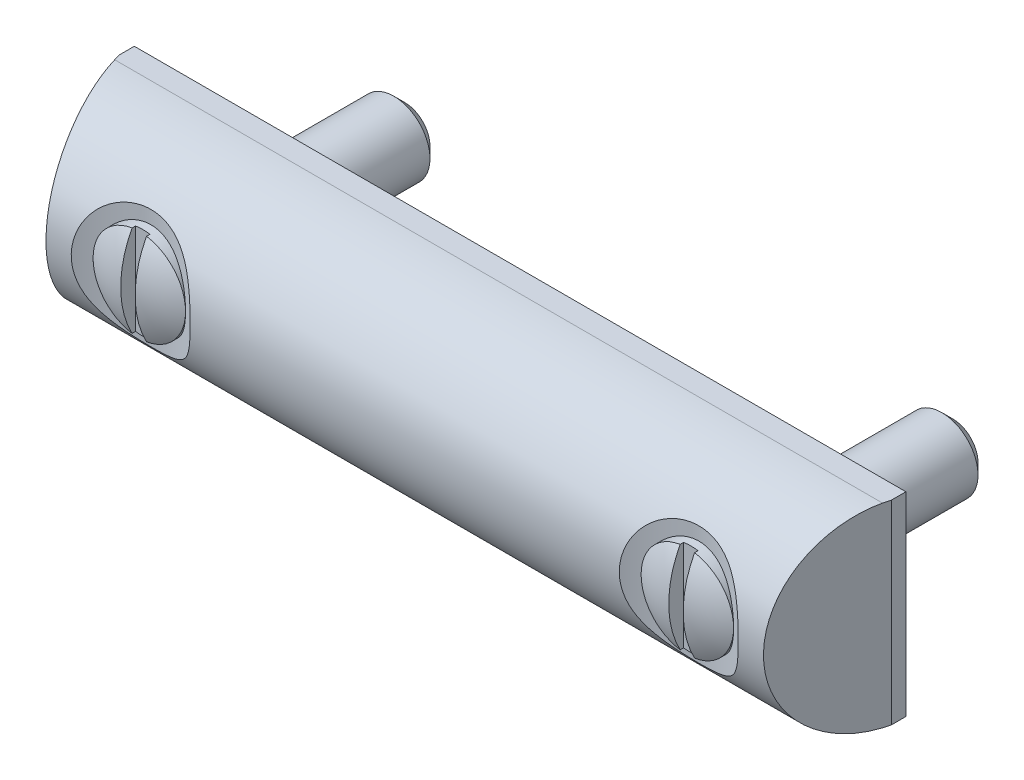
ISO-10303-21;
HEADER;
FILE_DESCRIPTION(('STEP AP214'),'2;1');
FILE_NAME('part.step','',(''),(''),'','','');
FILE_SCHEMA(('AUTOMOTIVE_DESIGN { 1 0 10303 214 1 1 1 1 }'));
ENDSEC;
DATA;
#1=APPLICATION_CONTEXT('core data for automotive mechanical design processes');
#2=APPLICATION_PROTOCOL_DEFINITION('international standard','automotive_design',2000,#1);
#3=PRODUCT_CONTEXT('',#1,'mechanical');
#4=PRODUCT('Part','Part','',(#3));
#5=PRODUCT_RELATED_PRODUCT_CATEGORY('part','',(#4));
#6=PRODUCT_DEFINITION_FORMATION('','',#4);
#7=PRODUCT_DEFINITION_CONTEXT('part definition',#1,'design');
#8=PRODUCT_DEFINITION('design','',#6,#7);
#9=PRODUCT_DEFINITION_SHAPE('','',#8);
#10=(LENGTH_UNIT() NAMED_UNIT(*) SI_UNIT(.MILLI.,.METRE.));
#11=(NAMED_UNIT(*) PLANE_ANGLE_UNIT() SI_UNIT($,.RADIAN.));
#12=(NAMED_UNIT(*) SI_UNIT($,.STERADIAN.) SOLID_ANGLE_UNIT());
#13=UNCERTAINTY_MEASURE_WITH_UNIT(LENGTH_MEASURE(1.E-05),#10,'distance_accuracy_value','');
#14=(GEOMETRIC_REPRESENTATION_CONTEXT(3) GLOBAL_UNCERTAINTY_ASSIGNED_CONTEXT((#13)) GLOBAL_UNIT_ASSIGNED_CONTEXT((#10,
#11,#12)) REPRESENTATION_CONTEXT('',''));
#15=CARTESIAN_POINT('',(0.,0.,0.));
#16=DIRECTION('',(0.,0.,1.));
#17=DIRECTION('',(1.,0.,0.));
#18=AXIS2_PLACEMENT_3D('',#15,#16,#17);
#19=CARTESIAN_POINT('',(76.,0.,2.92571841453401));
#20=DIRECTION('',(0.,-1.,0.));
#21=DIRECTION('',(0.,0.,-1.));
#22=AXIS2_PLACEMENT_3D('',#19,#20,#21);
#23=SPHERICAL_SURFACE('',#22,13.5);
#24=CARTESIAN_POINT('',(75.,0.,2.92571841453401));
#25=DIRECTION('',(-1.,0.,0.));
#26=DIRECTION('',(0.,0.,1.));
#27=AXIS2_PLACEMENT_3D('',#24,#25,#26);
#28=CIRCLE('',#27,13.4629120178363);
#29=CARTESIAN_POINT('',(75.,6.33249664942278,14.8063533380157));
#30=VERTEX_POINT('',#29);
#31=CARTESIAN_POINT('',(75.,-6.33249664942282,14.8063533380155));
#32=VERTEX_POINT('',#31);
#33=EDGE_CURVE('E138',#30,#32,#28,.F.);
#34=ORIENTED_EDGE('',*,*,#33,.F.);
#35=CARTESIAN_POINT('',(76.,0.,14.8063533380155));
#36=DIRECTION('',(0.,0.,-1.));
#37=DIRECTION('',(0.,1.,0.));
#38=AXIS2_PLACEMENT_3D('',#35,#36,#37);
#39=CIRCLE('',#38,6.41096824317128);
#40=CARTESIAN_POINT('',(69.5890317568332,0.,14.8063533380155));
#41=VERTEX_POINT('',#40);
#42=EDGE_CURVE('E195',#41,#30,#39,.T.);
#43=ORIENTED_EDGE('',*,*,#42,.F.);
#44=EDGE_CURVE('E194',#32,#41,#39,.T.);
#45=ORIENTED_EDGE('',*,*,#44,.F.);
#46=EDGE_LOOP('',(#34,#43,#45));
#47=FACE_BOUND('',#46,.T.);
#48=ADVANCED_FACE('F14',(#47),#23,.T.);
#49=CARTESIAN_POINT('',(1.94289029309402E-13,0.,2.92571841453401));
#50=DIRECTION('',(0.,-1.,0.));
#51=DIRECTION('',(0.,0.,-1.));
#52=AXIS2_PLACEMENT_3D('',#49,#50,#51);
#53=SPHERICAL_SURFACE('',#52,13.5);
#54=CARTESIAN_POINT('',(-1.,0.,2.92571841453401));
#55=DIRECTION('',(-1.,0.,0.));
#56=DIRECTION('',(0.,0.,1.));
#57=AXIS2_PLACEMENT_3D('',#54,#55,#56);
#58=CIRCLE('',#57,13.4629120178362);
#59=CARTESIAN_POINT('',(-1.,6.33249664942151,14.8063533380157));
#60=VERTEX_POINT('',#59);
#61=CARTESIAN_POINT('',(-1.,-6.33249664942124,14.8063533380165));
#62=VERTEX_POINT('',#61);
#63=EDGE_CURVE('E168',#60,#62,#58,.F.);
#64=ORIENTED_EDGE('',*,*,#63,.F.);
#65=CARTESIAN_POINT('',(0.,0.,14.8063533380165));
#66=DIRECTION('',(0.,0.,-1.));
#67=DIRECTION('',(0.,1.,0.));
#68=AXIS2_PLACEMENT_3D('',#65,#66,#67);
#69=CIRCLE('',#68,6.41096824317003);
#70=CARTESIAN_POINT('',(-6.4109682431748,0.,14.8063533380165));
#71=VERTEX_POINT('',#70);
#72=EDGE_CURVE('E179',#71,#60,#69,.T.);
#73=ORIENTED_EDGE('',*,*,#72,.F.);
#74=EDGE_CURVE('E178',#62,#71,#69,.T.);
#75=ORIENTED_EDGE('',*,*,#74,.F.);
#76=EDGE_LOOP('',(#64,#73,#75));
#77=FACE_BOUND('',#76,.T.);
#78=ADVANCED_FACE('F284',(#77),#53,.T.);
#79=CARTESIAN_POINT('',(-15.5,-13.5,0.));
#80=DIRECTION('',(0.,0.,1.));
#81=DIRECTION('',(0.,-1.,0.));
#82=AXIS2_PLACEMENT_3D('',#79,#80,#81);
#83=PLANE('',#82);
#84=DIRECTION('',(0.,1.,0.));
#85=VECTOR('',#84,1.);
#86=CARTESIAN_POINT('',(91.5,-13.5,0.));
#87=LINE('',#86,#85);
#88=CARTESIAN_POINT('',(91.5,-13.5,0.));
#89=VERTEX_POINT('',#88);
#90=CARTESIAN_POINT('',(91.5,13.5,0.));
#91=VERTEX_POINT('',#90);
#92=EDGE_CURVE('E336',#89,#91,#87,.T.);
#93=ORIENTED_EDGE('',*,*,#92,.F.);
#94=DIRECTION('',(1.,0.,0.));
#95=VECTOR('',#94,1.);
#96=CARTESIAN_POINT('',(-15.5,-13.5,0.));
#97=LINE('',#96,#95);
#98=CARTESIAN_POINT('',(-15.5,-13.5,0.));
#99=VERTEX_POINT('',#98);
#100=EDGE_CURVE('E346',#99,#89,#97,.T.);
#101=ORIENTED_EDGE('',*,*,#100,.F.);
#102=DIRECTION('',(0.,1.,0.));
#103=VECTOR('',#102,1.);
#104=CARTESIAN_POINT('',(-15.5,-13.5,0.));
#105=LINE('',#104,#103);
#106=CARTESIAN_POINT('',(-15.5,13.5,0.));
#107=VERTEX_POINT('',#106);
#108=EDGE_CURVE('E334',#99,#107,#105,.T.);
#109=ORIENTED_EDGE('',*,*,#108,.T.);
#110=DIRECTION('',(1.,0.,0.));
#111=VECTOR('',#110,1.);
#112=CARTESIAN_POINT('',(-15.5,13.5,0.));
#113=LINE('',#112,#111);
#114=EDGE_CURVE('E361',#107,#91,#113,.T.);
#115=ORIENTED_EDGE('',*,*,#114,.T.);
#116=EDGE_LOOP('',(#93,#101,#109,#115));
#117=FACE_BOUND('',#116,.T.);
#118=CARTESIAN_POINT('',(76.,0.,0.));
#119=DIRECTION('',(0.,0.,1.));
#120=DIRECTION('',(0.,-1.,0.));
#121=AXIS2_PLACEMENT_3D('',#118,#119,#120);
#122=CIRCLE('',#121,4.99999999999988);
#123=CARTESIAN_POINT('',(76.,-4.99999999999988,0.));
#124=VERTEX_POINT('',#123);
#125=EDGE_CURVE('E255',#124,#124,#122,.F.);
#126=ORIENTED_EDGE('',*,*,#125,.F.);
#127=EDGE_LOOP('',(#126));
#128=FACE_BOUND('',#127,.T.);
#129=CARTESIAN_POINT('',(0.,0.,0.));
#130=DIRECTION('',(0.,0.,1.));
#131=DIRECTION('',(0.,-1.,0.));
#132=AXIS2_PLACEMENT_3D('',#129,#130,#131);
#133=CIRCLE('',#132,5.);
#134=CARTESIAN_POINT('',(0.,-5.,0.));
#135=VERTEX_POINT('',#134);
#136=EDGE_CURVE('E257',#135,#135,#133,.F.);
#137=ORIENTED_EDGE('',*,*,#136,.F.);
#138=EDGE_LOOP('',(#137));
#139=FACE_BOUND('',#138,.T.);
#140=ADVANCED_FACE('F242',(#117,#128,#139),#83,.F.);
#141=CARTESIAN_POINT('',(-1.38777878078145E-12,-13.5,26.6971328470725));
#142=DIRECTION('',(0.,1.,0.));
#143=DIRECTION('',(0.,0.,1.));
#144=AXIS2_PLACEMENT_3D('',#141,#142,#143);
#145=CYLINDRICAL_SURFACE('',#144,13.5089285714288);
#146=CARTESIAN_POINT('',(-1.38777878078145E-12,-8.2500000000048,13.1882042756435));
#147=CARTESIAN_POINT('',(-0.225295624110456,-8.25000002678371,13.1882056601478));
#148=CARTESIAN_POINT('',(-0.450660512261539,-8.24269330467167,13.1938517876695));
#149=CARTESIAN_POINT('',(-0.899969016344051,-8.21341348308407,13.2163370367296));
#150=CARTESIAN_POINT('',(-1.12391173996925,-8.19143194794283,13.2331825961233));
#151=CARTESIAN_POINT('',(-1.56926737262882,-8.13260092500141,13.2777910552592));
#152=CARTESIAN_POINT('',(-1.79067345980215,-8.09571811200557,13.3055784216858));
#153=CARTESIAN_POINT('',(-2.22884486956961,-8.00690155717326,13.371500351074));
#154=CARTESIAN_POINT('',(-2.44561088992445,-7.95497009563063,13.409633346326));
#155=CARTESIAN_POINT('',(-2.87311036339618,-7.83580189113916,13.4954683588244));
#156=CARTESIAN_POINT('',(-3.08383999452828,-7.76855568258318,13.5431762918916));
#157=CARTESIAN_POINT('',(-3.49756815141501,-7.61857958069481,13.647088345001));
#158=CARTESIAN_POINT('',(-3.70056641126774,-7.53584915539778,13.7032927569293));
#159=CARTESIAN_POINT('',(-4.09711920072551,-7.35486857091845,13.8228322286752));
#160=CARTESIAN_POINT('',(-4.29068158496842,-7.25663161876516,13.886161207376));
#161=CARTESIAN_POINT('',(-4.66707726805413,-7.04461505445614,14.0184367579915));
#162=CARTESIAN_POINT('',(-4.84991090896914,-6.93083593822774,14.0873831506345));
#163=CARTESIAN_POINT('',(-5.20037817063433,-6.69010563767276,14.2278812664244));
#164=CARTESIAN_POINT('',(-5.36822352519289,-6.56342319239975,14.2993652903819));
#165=CARTESIAN_POINT('',(-5.69115763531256,-6.295704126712,14.4442474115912));
#166=CARTESIAN_POINT('',(-5.84624650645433,-6.15466763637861,14.5176454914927));
#167=CARTESIAN_POINT('',(-6.14276260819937,-5.85890704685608,14.6644690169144));
#168=CARTESIAN_POINT('',(-6.2841896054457,-5.70418271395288,14.7378944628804));
#169=CARTESIAN_POINT('',(-6.55270293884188,-5.38195019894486,14.8828819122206));
#170=CARTESIAN_POINT('',(-6.67978945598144,-5.21444217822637,14.9544439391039));
#171=CARTESIAN_POINT('',(-6.91597938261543,-4.87239416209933,15.0920234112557));
#172=CARTESIAN_POINT('',(-7.0254730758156,-4.69816238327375,15.1581379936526));
#173=CARTESIAN_POINT('',(-7.23026292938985,-4.33981031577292,15.2853413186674));
#174=CARTESIAN_POINT('',(-7.32555936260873,-4.15569021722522,15.3464301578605));
#175=CARTESIAN_POINT('',(-7.50193196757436,-3.77880488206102,15.4622183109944));
#176=CARTESIAN_POINT('',(-7.58300619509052,-3.58603846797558,15.5169167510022));
#177=CARTESIAN_POINT('',(-7.73100647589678,-3.19321333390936,15.6187411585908));
#178=CARTESIAN_POINT('',(-7.79793215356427,-2.99315442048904,15.6658669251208));
#179=CARTESIAN_POINT('',(-7.91917060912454,-2.58244150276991,15.7525645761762));
#180=CARTESIAN_POINT('',(-7.97315834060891,-2.37164968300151,15.7919380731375));
#181=CARTESIAN_POINT('',(-8.06669353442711,-1.94532468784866,15.8609441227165));
#182=CARTESIAN_POINT('',(-8.10624081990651,-1.72979145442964,15.8905765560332));
#183=CARTESIAN_POINT('',(-8.17108806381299,-1.29538802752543,15.9395251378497));
#184=CARTESIAN_POINT('',(-8.19638484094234,-1.07651710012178,15.9588389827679));
#185=CARTESIAN_POINT('',(-8.232854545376,-0.636922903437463,15.9867741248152));
#186=CARTESIAN_POINT('',(-8.24402713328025,-0.416199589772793,15.9953951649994));
#187=CARTESIAN_POINT('',(-8.25247420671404,0.034301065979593,16.00190699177));
#188=CARTESIAN_POINT('',(-8.24918905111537,0.264095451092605,15.9993657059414));
#189=CARTESIAN_POINT('',(-8.22741812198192,0.722541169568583,15.9826133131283));
#190=CARTESIAN_POINT('',(-8.20893193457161,0.951192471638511,15.9684018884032));
#191=CARTESIAN_POINT('',(-8.15664377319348,1.40575466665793,15.9285956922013));
#192=CARTESIAN_POINT('',(-8.12284085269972,1.63166538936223,15.9030002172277));
#193=CARTESIAN_POINT('',(-8.03973350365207,2.07910537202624,15.8409584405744));
#194=CARTESIAN_POINT('',(-7.99042920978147,2.30063467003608,15.8045122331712));
#195=CARTESIAN_POINT('',(-7.87582802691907,2.73869648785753,15.721363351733));
#196=CARTESIAN_POINT('',(-7.81045758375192,2.95520086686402,15.6746136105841));
#197=CARTESIAN_POINT('',(-7.66362785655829,3.38047175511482,15.5720272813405));
#198=CARTESIAN_POINT('',(-7.58216848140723,3.58923822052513,15.5161906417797));
#199=CARTESIAN_POINT('',(-7.40304910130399,3.99732150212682,15.3967970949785));
#200=CARTESIAN_POINT('',(-7.30539453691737,4.19664146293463,15.3332427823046));
#201=CARTESIAN_POINT('',(-7.09386524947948,4.5843264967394,15.2000097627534));
#202=CARTESIAN_POINT('',(-6.97999118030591,4.77269201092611,15.1303313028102));
#203=CARTESIAN_POINT('',(-6.74059969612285,5.13048180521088,14.9892696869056));
#204=CARTESIAN_POINT('',(-6.61564630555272,5.30034310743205,14.9180372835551));
#205=CARTESIAN_POINT('',(-6.35125340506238,5.62739303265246,14.7733991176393));
#206=CARTESIAN_POINT('',(-6.2118142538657,5.78458196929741,14.6999934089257));
#207=CARTESIAN_POINT('',(-5.91911117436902,6.08532392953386,14.5529124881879));
#208=CARTESIAN_POINT('',(-5.76584925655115,6.22887892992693,14.4792373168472));
#209=CARTESIAN_POINT('',(-5.44635999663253,6.50166782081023,14.3335115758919));
#210=CARTESIAN_POINT('',(-5.28013279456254,6.63090186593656,14.261460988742));
#211=CARTESIAN_POINT('',(-4.94072323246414,6.87109759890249,14.1228319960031));
#212=CARTESIAN_POINT('',(-4.76787495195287,6.98247563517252,14.0561560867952));
#213=CARTESIAN_POINT('',(-4.41212613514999,7.19104726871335,13.927635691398));
#214=CARTESIAN_POINT('',(-4.22922581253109,7.28824116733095,13.8657911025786));
#215=CARTESIAN_POINT('',(-3.85460167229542,7.46840441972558,13.7483206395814));
#216=CARTESIAN_POINT('',(-3.66287647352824,7.55137153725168,13.6926957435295));
#217=CARTESIAN_POINT('',(-3.2719531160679,7.70313730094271,13.5888768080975));
#218=CARTESIAN_POINT('',(-3.0727547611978,7.77193557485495,13.540682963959));
#219=CARTESIAN_POINT('',(-2.66390022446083,7.89684245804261,13.4517757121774));
#220=CARTESIAN_POINT('',(-2.45411131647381,7.95264674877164,13.4112452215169));
#221=CARTESIAN_POINT('',(-2.02961481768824,8.0498272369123,13.3398073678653));
#222=CARTESIAN_POINT('',(-1.81490717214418,8.09120327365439,13.3089001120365));
#223=CARTESIAN_POINT('',(-1.38197420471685,8.15972394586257,13.2573102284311));
#224=CARTESIAN_POINT('',(-1.1637481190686,8.18686544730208,13.2366298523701));
#225=CARTESIAN_POINT('',(-0.725257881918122,8.22704787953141,13.2058963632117));
#226=CARTESIAN_POINT('',(-0.504993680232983,8.2400884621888,13.1958435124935));
#227=CARTESIAN_POINT('',(-0.0551406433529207,8.25238116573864,13.1863706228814));
#228=CARTESIAN_POINT('',(0.174473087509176,8.25106873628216,13.187385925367));
#229=CARTESIAN_POINT('',(0.632768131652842,8.23327945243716,13.201084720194));
#230=CARTESIAN_POINT('',(0.861449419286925,8.21680218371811,13.2137685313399));
#231=CARTESIAN_POINT('',(1.31629094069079,8.1685794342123,13.2505500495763));
#232=CARTESIAN_POINT('',(1.54245098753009,8.1368328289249,13.274648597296));
#233=CARTESIAN_POINT('',(1.99061302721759,8.05789385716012,13.3337614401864));
#234=CARTESIAN_POINT('',(2.21261505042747,8.01070160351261,13.3687756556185));
#235=CARTESIAN_POINT('',(2.65219140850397,7.90030869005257,13.4492174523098));
#236=CARTESIAN_POINT('',(2.86972973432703,7.83701054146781,13.4947082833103));
#237=CARTESIAN_POINT('',(3.29727833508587,7.69433106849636,13.5949453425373));
#238=CARTESIAN_POINT('',(3.50728855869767,7.61494963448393,13.6496916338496));
#239=CARTESIAN_POINT('',(3.9180618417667,7.43997675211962,13.7671073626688));
#240=CARTESIAN_POINT('',(4.11882791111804,7.34439062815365,13.8297741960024));
#241=CARTESIAN_POINT('',(4.5095917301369,7.13696775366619,13.9614647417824));
#242=CARTESIAN_POINT('',(4.69958991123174,7.02513165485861,14.0304881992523));
#243=CARTESIAN_POINT('',(5.06089909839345,6.78958575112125,14.1705739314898));
#244=CARTESIAN_POINT('',(5.23263163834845,6.66642936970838,14.2414799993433));
#245=CARTESIAN_POINT('',(5.56352876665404,6.40551999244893,14.3857203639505));
#246=CARTESIAN_POINT('',(5.72269365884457,6.26776734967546,14.459054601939));
#247=CARTESIAN_POINT('',(6.02745656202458,5.97829933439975,14.606245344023));
#248=CARTESIAN_POINT('',(6.1730567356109,5.82658619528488,14.6801017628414));
#249=CARTESIAN_POINT('',(6.44997300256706,5.51002895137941,14.8264322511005));
#250=CARTESIAN_POINT('',(6.58128927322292,5.34518500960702,14.8989063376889));
#251=CARTESIAN_POINT('',(6.82543946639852,5.00853196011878,15.0385000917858));
#252=CARTESIAN_POINT('',(6.93870751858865,4.83707675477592,15.105714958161));
#253=CARTESIAN_POINT('',(7.15107343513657,4.4839504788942,15.235510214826));
#254=CARTESIAN_POINT('',(7.25017161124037,4.30227963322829,15.2980907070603));
#255=CARTESIAN_POINT('',(7.43413719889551,3.92994051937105,15.4172050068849));
#256=CARTESIAN_POINT('',(7.51900243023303,3.73927087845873,15.4737378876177));
#257=CARTESIAN_POINT('',(7.67454417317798,3.35027787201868,15.5795173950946));
#258=CARTESIAN_POINT('',(7.74522032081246,3.15195431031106,15.6287638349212));
#259=CARTESIAN_POINT('',(7.87379836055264,2.74498942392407,15.7198478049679));
#260=CARTESIAN_POINT('',(7.93141707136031,2.53622116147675,15.7615178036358));
#261=CARTESIAN_POINT('',(8.03223792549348,2.11358942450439,15.835355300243));
#262=CARTESIAN_POINT('',(8.07543992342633,1.89972589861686,15.8675227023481));
#263=CARTESIAN_POINT('',(8.1476272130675,1.46830082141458,15.9217274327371));
#264=CARTESIAN_POINT('',(8.1766093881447,1.25073847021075,15.9437625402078));
#265=CARTESIAN_POINT('',(8.22049461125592,0.813390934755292,15.9772736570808));
#266=CARTESIAN_POINT('',(8.23539730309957,0.593605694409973,15.9887493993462));
#267=CARTESIAN_POINT('',(8.2515225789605,0.14445587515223,16.0011691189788));
#268=CARTESIAN_POINT('',(8.2521765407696,-0.0849415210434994,16.0016753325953));
#269=CARTESIAN_POINT('',(8.23835570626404,-0.543013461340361,15.9910261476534));
#270=CARTESIAN_POINT('',(8.22388049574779,-0.771687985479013,15.9798704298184));
#271=CARTESIAN_POINT('',(8.17970923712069,-1.22673380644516,15.9461198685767));
#272=CARTESIAN_POINT('',(8.15001191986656,-1.4531049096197,15.9235240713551));
#273=CARTESIAN_POINT('',(8.07522758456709,-1.90191158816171,15.8673574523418));
#274=CARTESIAN_POINT('',(8.03014065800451,-2.12434718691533,15.8337866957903));
#275=CARTESIAN_POINT('',(7.9239512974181,-2.56535655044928,15.7560859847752));
#276=CARTESIAN_POINT('',(7.86272789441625,-2.78388723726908,15.7118765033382));
#277=CARTESIAN_POINT('',(7.72420674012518,-3.21363218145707,15.6140391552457));
#278=CARTESIAN_POINT('',(7.64690886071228,-3.4248463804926,15.5604112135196));
#279=CARTESIAN_POINT('',(7.476096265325,-3.8382372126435,15.4450331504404));
#280=CARTESIAN_POINT('',(7.382586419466,-4.0404165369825,15.3832854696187));
#281=CARTESIAN_POINT('',(7.17929029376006,-4.43419693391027,15.2532046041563));
#282=CARTESIAN_POINT('',(7.06950466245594,-4.6257984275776,15.1848716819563));
#283=CARTESIAN_POINT('',(6.83782518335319,-4.99059604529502,15.0458277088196));
#284=CARTESIAN_POINT('',(6.71647224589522,-5.16419709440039,14.9752773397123));
#285=CARTESIAN_POINT('',(6.45906095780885,-5.49893878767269,14.831493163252));
#286=CARTESIAN_POINT('',(6.32300294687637,-5.66007971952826,14.7582594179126));
#287=CARTESIAN_POINT('',(6.0368050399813,-5.96884788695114,14.6110244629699));
#288=CARTESIAN_POINT('',(5.88666930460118,-6.11647908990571,14.537023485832));
#289=CARTESIAN_POINT('',(5.57310590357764,-6.39750020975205,14.3901590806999));
#290=CARTESIAN_POINT('',(5.40967845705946,-6.53089036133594,14.3172956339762));
#291=CARTESIAN_POINT('',(5.07587604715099,-6.77895766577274,14.1768137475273));
#292=CARTESIAN_POINT('',(4.90587715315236,-6.89408895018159,14.1091025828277));
#293=CARTESIAN_POINT('',(4.55550458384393,-7.11020636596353,13.9781115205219));
#294=CARTESIAN_POINT('',(4.37513105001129,-7.21119269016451,13.914831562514));
#295=CARTESIAN_POINT('',(4.0051062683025,-7.39899334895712,13.7941031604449));
#296=CARTESIAN_POINT('',(3.81544818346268,-7.48579702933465,13.7366591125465));
#297=CARTESIAN_POINT('',(3.42829860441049,-7.6451833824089,13.6289159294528));
#298=CARTESIAN_POINT('',(3.23080719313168,-7.71776620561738,13.5786167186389));
#299=CARTESIAN_POINT('',(2.82546485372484,-7.8501160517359,13.4853206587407));
#300=CARTESIAN_POINT('',(2.6174875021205,-7.90960841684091,13.4424836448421));
#301=CARTESIAN_POINT('',(2.19621758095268,-8.01416171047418,13.3662061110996));
#302=CARTESIAN_POINT('',(1.98292418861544,-8.05922038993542,13.3327670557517));
#303=CARTESIAN_POINT('',(1.5529526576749,-8.13501064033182,13.2760141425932));
#304=CARTESIAN_POINT('',(1.33628237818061,-8.16577147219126,13.2526796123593));
#305=CARTESIAN_POINT('',(0.900630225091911,-8.2132488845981,13.2164894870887));
#306=CARTESIAN_POINT('',(0.681649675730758,-8.22997311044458,13.2036281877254));
#307=CARTESIAN_POINT('',(0.385275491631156,-8.24315618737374,13.1934794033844));
#308=CARTESIAN_POINT('',(0.308258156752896,-8.24572268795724,13.1915019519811));
#309=CARTESIAN_POINT('',(0.154163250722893,-8.24914458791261,13.1888641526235));
#310=CARTESIAN_POINT('',(0.0770856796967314,-8.2499999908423,13.1882038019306));
#311=CARTESIAN_POINT('',(-1.38777878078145E-12,-8.2500000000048,13.1882042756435));
#312=B_SPLINE_CURVE_WITH_KNOTS('',3,(#146,#147,#148,#149,#150,#151,#152,#153,#154,#155,#156,
#157,#158,#159,#160,#161,#162,#163,#164,#165,#166,#167,#168,#169,#170,#171,#172,#173,#174,#175,
#176,#177,#178,#179,#180,#181,#182,#183,#184,#185,#186,#187,#188,#189,#190,#191,#192,#193,#194,
#195,#196,#197,#198,#199,#200,#201,#202,#203,#204,#205,#206,#207,#208,#209,#210,#211,#212,#213,
#214,#215,#216,#217,#218,#219,#220,#221,#222,#223,#224,#225,#226,#227,#228,#229,#230,#231,#232,
#233,#234,#235,#236,#237,#238,#239,#240,#241,#242,#243,#244,#245,#246,#247,#248,#249,#250,#251,
#252,#253,#254,#255,#256,#257,#258,#259,#260,#261,#262,#263,#264,#265,#266,#267,#268,#269,#270,
#271,#272,#273,#274,#275,#276,#277,#278,#279,#280,#281,#282,#283,#284,#285,#286,#287,#288,#289,
#290,#291,#292,#293,#294,#295,#296,#297,#298,#299,#300,#301,#302,#303,#304,#305,#306,#307,#308,
#309,#310,#311),.UNSPECIFIED.,.T.,.F.,(4,2,2,2,2,2,2,2,2,2,2,2,2,2,2,2,2,2,2,2,2,2,2,2,2,2,2,2,
2,2,2,2,2,2,2,2,2,2,2,2,2,2,2,2,2,2,2,2,2,2,2,2,2,2,2,2,2,2,2,2,2,2,2,2,2,2,2,2,2,2,2,2,2,2,2,2,
2,2,2,2,2,2,4),(0.,0.675817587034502,1.35202399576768,2.02975111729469,2.70737559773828,
3.38542004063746,4.06348778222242,4.74098109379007,5.41845279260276,6.08393530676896,
6.74941179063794,7.4148996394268,8.08037908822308,8.72804661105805,9.37570168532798,
10.0234452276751,10.6712059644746,11.3338464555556,11.9964950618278,12.6592915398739,
13.3221039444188,14.0107939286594,14.6995026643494,15.3882539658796,16.0769992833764,
16.7689585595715,17.4609217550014,18.1526529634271,18.844356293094,19.5112530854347,
20.1781333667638,20.8449168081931,21.5116930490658,22.1594321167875,22.8071574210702,
23.4549844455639,24.1028284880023,24.7645882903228,25.4263554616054,26.0882682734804,
26.7501974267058,27.438253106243,28.1263275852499,28.814452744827,29.5025728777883,
30.1949616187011,30.887355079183,31.5795214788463,32.2716601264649,32.9395442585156,
33.6074122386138,34.275173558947,34.9429265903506,35.5907824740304,36.2386241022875,
36.8865648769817,37.5345222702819,38.1954149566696,38.8563143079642,39.5173584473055,
40.1784193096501,40.8658147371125,41.5532289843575,42.2407005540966,42.9281680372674,
43.6209435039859,44.3137244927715,45.0062977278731,45.6988433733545,46.3677604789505,
47.0366621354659,47.7053667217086,48.3740602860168,49.021882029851,49.6696949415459,
50.3179922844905,50.9662827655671,51.6270967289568,52.2880136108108,52.9475718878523,
53.6067706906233,53.8380045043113,54.0692378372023),.UNSPECIFIED.);
#313=CARTESIAN_POINT('',(-1.38777878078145E-12,-8.2500000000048,13.1882042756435));
#314=VERTEX_POINT('',#313);
#315=EDGE_CURVE('E210',#314,#314,#312,.T.);
#316=ORIENTED_EDGE('',*,*,#315,.F.);
#317=EDGE_LOOP('',(#316));
#318=FACE_BOUND('',#317,.T.);
#319=CARTESIAN_POINT('',(0.,6.41096824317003,13.1882042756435));
#320=CARTESIAN_POINT('',(0.169608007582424,6.41096717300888,13.1882052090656));
#321=CARTESIAN_POINT('',(0.339242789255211,6.40422925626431,13.1914064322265));
#322=CARTESIAN_POINT('',(0.677276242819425,6.37734906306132,13.2041316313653));
#323=CARTESIAN_POINT('',(0.845674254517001,6.35720008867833,13.2136587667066));
#324=CARTESIAN_POINT('',(1.18017924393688,6.30368348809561,13.2388081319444));
#325=CARTESIAN_POINT('',(1.34628199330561,6.27029415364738,13.2544403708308));
#326=CARTESIAN_POINT('',(1.67479063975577,6.19065185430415,13.2914040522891));
#327=CARTESIAN_POINT('',(1.83719499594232,6.14439363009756,13.3127378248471));
#328=CARTESIAN_POINT('',(2.15649182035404,6.03971574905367,13.3604674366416));
#329=CARTESIAN_POINT('',(2.31340456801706,5.98134796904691,13.3868416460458));
#330=CARTESIAN_POINT('',(2.62154817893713,5.85285232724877,13.4440875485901));
#331=CARTESIAN_POINT('',(2.77277688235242,5.78272004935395,13.4749609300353));
#332=CARTESIAN_POINT('',(3.06859186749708,5.63132684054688,13.5404682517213));
#333=CARTESIAN_POINT('',(3.21318202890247,5.55007252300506,13.5750999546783));
#334=CARTESIAN_POINT('',(3.49512466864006,5.37698913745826,13.6473636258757));
#335=CARTESIAN_POINT('',(3.63247447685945,5.28515620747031,13.6849966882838));
#336=CARTESIAN_POINT('',(4.04753864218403,4.98386920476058,13.8054934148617));
#337=CARTESIAN_POINT('',(4.31179443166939,4.75702110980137,13.8921873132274));
#338=CARTESIAN_POINT('',(4.80011971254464,4.26379237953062,14.0671098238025));
#339=CARTESIAN_POINT('',(5.02416180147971,3.99738501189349,14.1553394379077));
#340=CARTESIAN_POINT('',(5.33320580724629,3.56258254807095,14.2849723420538));
#341=CARTESIAN_POINT('',(5.43439236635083,3.4062708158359,14.3290594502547));
#342=CARTESIAN_POINT('',(5.62312616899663,3.08474906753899,14.4137176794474));
#343=CARTESIAN_POINT('',(5.7106791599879,2.91954284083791,14.4542902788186));
#344=CARTESIAN_POINT('',(5.87137772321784,2.58118562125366,14.5305394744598));
#345=CARTESIAN_POINT('',(5.94452380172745,2.40803490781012,14.56621624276));
#346=CARTESIAN_POINT('',(6.07559289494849,2.05501896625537,14.6313265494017));
#347=CARTESIAN_POINT('',(6.13352452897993,1.87515760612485,14.6607636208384));
#348=CARTESIAN_POINT('',(6.23065305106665,1.52032199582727,14.7107685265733));
#349=CARTESIAN_POINT('',(6.27072205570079,1.34564393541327,14.7317428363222));
#350=CARTESIAN_POINT('',(6.33615013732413,0.9929087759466,14.7662600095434));
#351=CARTESIAN_POINT('',(6.36151666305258,0.814853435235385,14.7798066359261));
#352=CARTESIAN_POINT('',(6.39719437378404,0.456896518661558,14.7989200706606));
#353=CARTESIAN_POINT('',(6.40751266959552,0.276995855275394,14.8044906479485));
#354=CARTESIAN_POINT('',(6.41295759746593,-0.0830953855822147,14.8074255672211));
#355=CARTESIAN_POINT('',(6.40808543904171,-0.263285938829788,14.804790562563));
#356=CARTESIAN_POINT('',(6.38454197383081,-0.603372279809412,14.7921371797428));
#357=CARTESIAN_POINT('',(6.36737915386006,-0.763405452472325,14.7829262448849));
#358=CARTESIAN_POINT('',(6.32116148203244,-1.0813145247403,14.7583408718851));
#359=CARTESIAN_POINT('',(6.29210284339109,-1.2391897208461,14.7429644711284));
#360=CARTESIAN_POINT('',(6.22241501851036,-1.55166999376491,14.7065429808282));
#361=CARTESIAN_POINT('',(6.18178773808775,-1.706275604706,14.6854988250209));
#362=CARTESIAN_POINT('',(6.08937021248,-2.01134969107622,14.6383849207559));
#363=CARTESIAN_POINT('',(6.03757560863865,-2.16181652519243,14.612313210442));
#364=CARTESIAN_POINT('',(5.86348866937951,-2.61249435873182,14.5263597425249));
#365=CARTESIAN_POINT('',(5.7240626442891,-2.9049816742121,14.459603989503));
#366=CARTESIAN_POINT('',(5.4044306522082,-3.46358899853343,14.3151320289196));
#367=CARTESIAN_POINT('',(5.22420668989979,-3.72969729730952,14.2374109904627));
#368=CARTESIAN_POINT('',(4.80435206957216,-4.25975576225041,14.0691447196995));
#369=CARTESIAN_POINT('',(4.56031475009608,-4.52008079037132,13.9781415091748));
#370=CARTESIAN_POINT('',(4.03128691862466,-4.99760989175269,13.8007189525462));
#371=CARTESIAN_POINT('',(3.7462804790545,-5.21479711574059,13.7143014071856));
#372=CARTESIAN_POINT('',(3.28710107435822,-5.50728684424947,13.5932163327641));
#373=CARTESIAN_POINT('',(3.1254549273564,-5.60062893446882,13.5536311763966));
#374=CARTESIAN_POINT('',(2.79379759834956,-5.77322286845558,13.4791653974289));
#375=CARTESIAN_POINT('',(2.62378994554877,-5.85248059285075,13.4442828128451));
#376=CARTESIAN_POINT('',(2.27661460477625,-5.99606744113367,13.3802512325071));
#377=CARTESIAN_POINT('',(2.09944944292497,-6.06040177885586,13.3511002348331));
#378=CARTESIAN_POINT('',(1.73925756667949,-6.1734195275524,13.2994010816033));
#379=CARTESIAN_POINT('',(1.55623145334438,-6.22210453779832,13.2768522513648));
#380=CARTESIAN_POINT('',(1.2001470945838,-6.30006160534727,13.2405240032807));
#381=CARTESIAN_POINT('',(1.02740759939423,-6.33054053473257,13.2262027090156));
#382=CARTESIAN_POINT('',(0.67959990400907,-6.37725945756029,13.2041847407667));
#383=CARTESIAN_POINT('',(0.504531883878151,-6.39350054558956,13.1964875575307));
#384=CARTESIAN_POINT('',(0.153545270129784,-6.41153712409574,13.1879366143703));
#385=CARTESIAN_POINT('',(-0.0223730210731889,-6.41333741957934,13.1870805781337));
#386=CARTESIAN_POINT('',(-0.373658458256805,-6.40248149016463,13.19223067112));
#387=CARTESIAN_POINT('',(-0.549025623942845,-6.38982578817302,13.1982365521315));
#388=CARTESIAN_POINT('',(-0.885814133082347,-6.35158048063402,13.2162963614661));
#389=CARTESIAN_POINT('',(-1.04736781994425,-6.32693634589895,13.2279077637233));
#390=CARTESIAN_POINT('',(-1.36770083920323,-6.26550180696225,13.2566561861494));
#391=CARTESIAN_POINT('',(-1.52647926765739,-6.22870752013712,13.2737949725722));
#392=CARTESIAN_POINT('',(-1.84013459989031,-6.14335642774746,13.3131859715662));
#393=CARTESIAN_POINT('',(-1.99501265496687,-6.09480313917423,13.3354366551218));
#394=CARTESIAN_POINT('',(-2.3000509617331,-5.98635921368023,13.3845524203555));
#395=CARTESIAN_POINT('',(-2.45020938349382,-5.92646424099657,13.4114192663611));
#396=CARTESIAN_POINT('',(-2.74934653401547,-5.79388968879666,13.4700336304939));
#397=CARTESIAN_POINT('',(-2.89815592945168,-5.72088156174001,13.5019030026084));
#398=CARTESIAN_POINT('',(-3.18909214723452,-5.56395189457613,13.5691786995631));
#399=CARTESIAN_POINT('',(-3.33121649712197,-5.48002635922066,13.604586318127));
#400=CARTESIAN_POINT('',(-3.746498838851,-5.2127257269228,13.7149628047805));
#401=CARTESIAN_POINT('',(-4.00872524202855,-5.01375558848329,13.7941177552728));
#402=CARTESIAN_POINT('',(-4.52107187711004,-4.55941159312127,13.9640846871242));
#403=CARTESIAN_POINT('',(-4.7679585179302,-4.30056614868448,14.0553037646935));
#404=CARTESIAN_POINT('',(-5.21620165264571,-3.74422102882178,14.2335611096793));
#405=CARTESIAN_POINT('',(-5.41753422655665,-3.44670117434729,14.3205971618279));
#406=CARTESIAN_POINT('',(-5.68418914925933,-2.97074039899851,14.4418817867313));
#407=CARTESIAN_POINT('',(-5.76833023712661,-2.80391977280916,14.4813727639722));
#408=CARTESIAN_POINT('',(-5.92207017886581,-2.46263445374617,14.555160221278));
#409=CARTESIAN_POINT('',(-5.9916759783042,-2.28817346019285,14.5894591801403));
#410=CARTESIAN_POINT('',(-6.11553661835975,-1.93289967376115,14.6515457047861));
#411=CARTESIAN_POINT('',(-6.16980221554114,-1.75209143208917,14.6793378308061));
#412=CARTESIAN_POINT('',(-6.26233260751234,-1.38543609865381,14.7272929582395));
#413=CARTESIAN_POINT('',(-6.3005995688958,-1.1995896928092,14.7474569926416));
#414=CARTESIAN_POINT('',(-6.35780723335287,-0.841756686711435,14.7778046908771));
#415=CARTESIAN_POINT('',(-6.37819989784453,-0.670064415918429,14.788734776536));
#416=CARTESIAN_POINT('',(-6.40504450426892,-0.325283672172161,14.8031514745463));
#417=CARTESIAN_POINT('',(-6.41149734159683,-0.152195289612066,14.8066385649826));
#418=CARTESIAN_POINT('',(-6.41037140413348,0.193874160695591,14.8060315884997));
#419=CARTESIAN_POINT('',(-6.4027963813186,0.36685524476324,14.8019395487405));
#420=CARTESIAN_POINT('',(-6.3737304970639,0.711298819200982,14.7863402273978));
#421=CARTESIAN_POINT('',(-6.352240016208,0.882761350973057,14.7748331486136));
#422=CARTESIAN_POINT('',(-6.29784736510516,1.20949255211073,14.7460184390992));
#423=CARTESIAN_POINT('',(-6.26596895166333,1.36497908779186,14.7292347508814));
#424=CARTESIAN_POINT('',(-6.19097637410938,1.67254760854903,14.6902709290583));
#425=CARTESIAN_POINT('',(-6.14785842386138,1.82462842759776,14.6680889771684));
#426=CARTESIAN_POINT('',(-6.00224110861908,2.2743703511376,14.5943979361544));
#427=CARTESIAN_POINT('',(-5.88344149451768,2.56574833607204,14.5357230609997));
#428=CARTESIAN_POINT('',(-5.59689146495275,3.14428360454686,14.4010970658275));
#429=CARTESIAN_POINT('',(-5.42640327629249,3.42986139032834,14.3242542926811));
#430=CARTESIAN_POINT('',(-5.04459331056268,3.9701579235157,14.1637303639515));
#431=CARTESIAN_POINT('',(-4.83325184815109,4.2248616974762,14.0800459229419));
#432=CARTESIAN_POINT('',(-4.34936464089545,4.72403613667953,13.9046790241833));
#433=CARTESIAN_POINT('',(-4.07271953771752,4.96461301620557,13.813081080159));
#434=CARTESIAN_POINT('',(-3.62866216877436,5.28838733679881,13.6837580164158));
#435=CARTESIAN_POINT('',(-3.47565623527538,5.39019904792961,13.6419647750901));
#436=CARTESIAN_POINT('',(-3.16075783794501,5.58067437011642,13.5621765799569));
#437=CARTESIAN_POINT('',(-2.99886951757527,5.66934404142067,13.5241798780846));
#438=CARTESIAN_POINT('',(-2.66755183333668,5.832556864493,13.4531163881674));
#439=CARTESIAN_POINT('',(-2.49814000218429,5.90713092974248,13.4200388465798));
#440=CARTESIAN_POINT('',(-2.15266865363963,6.04159427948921,13.3596709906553));
#441=CARTESIAN_POINT('',(-1.97661242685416,6.10149072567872,13.332377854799));
#442=CARTESIAN_POINT('',(-1.61953876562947,6.20581409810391,13.284429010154));
#443=CARTESIAN_POINT('',(-1.43853371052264,6.25027638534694,13.2637581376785));
#444=CARTESIAN_POINT('',(-1.07277047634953,6.32332320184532,13.2296161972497));
#445=CARTESIAN_POINT('',(-0.888014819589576,6.35191805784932,13.2161404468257));
#446=CARTESIAN_POINT('',(-0.585738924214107,6.38523050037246,13.2004040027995));
#447=CARTESIAN_POINT('',(-0.4688560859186,6.39487634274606,13.1958347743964));
#448=CARTESIAN_POINT('',(-0.234653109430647,6.4077456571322,13.1897345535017));
#449=CARTESIAN_POINT('',(-0.117332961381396,6.41096898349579,13.1882036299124));
#450=CARTESIAN_POINT('',(0.,6.41096824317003,13.1882042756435));
#451=B_SPLINE_CURVE_WITH_KNOTS('',3,(#319,#320,#321,#322,#323,#324,#325,#326,#327,#328,#329,
#330,#331,#332,#333,#334,#335,#336,#337,#338,#339,#340,#341,#342,#343,#344,#345,#346,#347,#348,
#349,#350,#351,#352,#353,#354,#355,#356,#357,#358,#359,#360,#361,#362,#363,#364,#365,#366,#367,
#368,#369,#370,#371,#372,#373,#374,#375,#376,#377,#378,#379,#380,#381,#382,#383,#384,#385,#386,
#387,#388,#389,#390,#391,#392,#393,#394,#395,#396,#397,#398,#399,#400,#401,#402,#403,#404,#405,
#406,#407,#408,#409,#410,#411,#412,#413,#414,#415,#416,#417,#418,#419,#420,#421,#422,#423,#424,
#425,#426,#427,#428,#429,#430,#431,#432,#433,#434,#435,#436,#437,#438,#439,#440,#441,#442,#443,
#444,#445,#446,#447,#448,#449,#450),.UNSPECIFIED.,.T.,.F.,(4,2,2,2,2,2,2,2,2,2,2,2,2,2,2,2,2,2,
2,2,2,2,2,2,2,2,2,2,2,2,2,2,2,2,2,2,2,2,2,2,2,2,2,2,2,2,2,2,2,2,2,2,2,2,2,2,2,2,2,2,2,2,2,2,2,
4),(0.,0.508707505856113,1.01766926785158,1.52746897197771,2.03747733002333,2.54534435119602,
3.05340244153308,3.56115973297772,4.06910298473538,5.14096977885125,6.21356421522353,
6.78700756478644,7.36020851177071,7.9333893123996,8.50624468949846,9.04680252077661,
9.5870862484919,10.127114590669,10.6670999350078,11.150173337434,11.6334006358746,
12.1165483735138,12.5998850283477,13.5879937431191,14.5765391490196,15.6765254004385,
16.7769404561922,17.3487414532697,17.9203031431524,18.4916648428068,19.0629681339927,
19.5902461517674,20.1174836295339,20.6445456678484,21.1715886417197,21.6625250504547,
22.1536184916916,22.6445652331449,23.1357000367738,23.641510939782,24.1475074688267,
25.1589745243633,26.2618142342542,27.3652316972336,27.9374912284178,28.5094766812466,
29.0810600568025,29.6525660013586,30.1715939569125,30.6905885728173,31.2094443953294,
31.7282860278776,32.2065562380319,32.6849877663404,33.6411940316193,34.6612162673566,
35.6817312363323,36.8095795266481,37.374438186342,37.9390355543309,38.5023799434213,
39.0654489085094,39.6272191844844,40.1886234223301,40.5405337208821,40.8924519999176),.UNSPECIFIED.);
#452=CARTESIAN_POINT('',(6.41096824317,-2.59420735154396E-13,14.806353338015));
#453=VERTEX_POINT('',#452);
#454=EDGE_CURVE('E246',#71,#453,#451,.T.);
#455=ORIENTED_EDGE('',*,*,#454,.T.);
#456=EDGE_CURVE('E254',#453,#71,#451,.T.);
#457=ORIENTED_EDGE('',*,*,#456,.T.);
#458=EDGE_LOOP('',(#455,#457));
#459=FACE_BOUND('',#458,.T.);
#460=ADVANCED_FACE('F239',(#318,#459),#145,.F.);
#461=CARTESIAN_POINT('',(76.0000000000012,-13.5,26.6971328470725));
#462=DIRECTION('',(0.,1.,0.));
#463=DIRECTION('',(0.,0.,1.));
#464=AXIS2_PLACEMENT_3D('',#461,#462,#463);
#465=CYLINDRICAL_SURFACE('',#464,13.508928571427);
#466=CARTESIAN_POINT('',(76.0000000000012,-8.25000000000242,13.1882042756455));
#467=CARTESIAN_POINT('',(75.7747043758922,-8.25000002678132,13.1882056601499));
#468=CARTESIAN_POINT('',(75.5493394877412,-8.2426933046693,13.1938517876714));
#469=CARTESIAN_POINT('',(75.1000309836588,-8.21341348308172,13.2163370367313));
#470=CARTESIAN_POINT('',(74.8760882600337,-8.19143194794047,13.233182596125));
#471=CARTESIAN_POINT('',(74.4307326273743,-8.13260092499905,13.277791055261));
#472=CARTESIAN_POINT('',(74.209326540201,-8.09571811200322,13.3055784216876));
#473=CARTESIAN_POINT('',(73.7711551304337,-8.00690155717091,13.3715003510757));
#474=CARTESIAN_POINT('',(73.554389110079,-7.95497009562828,13.4096333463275));
#475=CARTESIAN_POINT('',(73.1268896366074,-7.83580189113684,13.4954683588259));
#476=CARTESIAN_POINT('',(72.9161600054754,-7.76855568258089,13.5431762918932));
#477=CARTESIAN_POINT('',(72.5024318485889,-7.61857958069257,13.6470883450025));
#478=CARTESIAN_POINT('',(72.2994335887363,-7.53584915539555,13.7032927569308));
#479=CARTESIAN_POINT('',(71.9028807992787,-7.3548685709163,13.8228322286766));
#480=CARTESIAN_POINT('',(71.7093184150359,-7.25663161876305,13.8861612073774));
#481=CARTESIAN_POINT('',(71.3329227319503,-7.04461505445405,14.0184367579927));
#482=CARTESIAN_POINT('',(71.1500890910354,-6.93083593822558,14.0873831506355));
#483=CARTESIAN_POINT('',(70.7996218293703,-6.69010563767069,14.2278812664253));
#484=CARTESIAN_POINT('',(70.6317764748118,-6.56342319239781,14.2993652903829));
#485=CARTESIAN_POINT('',(70.3088423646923,-6.29570412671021,14.4442474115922));
#486=CARTESIAN_POINT('',(70.1537534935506,-6.15466763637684,14.5176454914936));
#487=CARTESIAN_POINT('',(69.8572373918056,-5.85890704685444,14.6644690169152));
#488=CARTESIAN_POINT('',(69.7158103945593,-5.70418271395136,14.7378944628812));
#489=CARTESIAN_POINT('',(69.4472970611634,-5.38195019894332,14.8828819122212));
#490=CARTESIAN_POINT('',(69.3202105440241,-5.2144421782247,14.9544439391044));
#491=CARTESIAN_POINT('',(69.0840206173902,-4.87239416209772,15.0920234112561));
#492=CARTESIAN_POINT('',(68.9745269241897,-4.69816238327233,15.1581379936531));
#493=CARTESIAN_POINT('',(68.7697370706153,-4.33981031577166,15.2853413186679));
#494=CARTESIAN_POINT('',(68.6744406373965,-4.15569021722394,15.3464301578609));
#495=CARTESIAN_POINT('',(68.498068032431,-3.77880488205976,15.4622183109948));
#496=CARTESIAN_POINT('',(68.4169938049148,-3.58603846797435,15.5169167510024));
#497=CARTESIAN_POINT('',(68.2689935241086,-3.19321333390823,15.6187411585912));
#498=CARTESIAN_POINT('',(68.2020678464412,-2.99315442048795,15.6658669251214));
#499=CARTESIAN_POINT('',(68.080829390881,-2.58244150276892,15.7525645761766));
#500=CARTESIAN_POINT('',(68.0268416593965,-2.37164968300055,15.7919380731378));
#501=CARTESIAN_POINT('',(67.9333064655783,-1.94532468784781,15.8609441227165));
#502=CARTESIAN_POINT('',(67.893759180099,-1.72979145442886,15.8905765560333));
#503=CARTESIAN_POINT('',(67.8289119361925,-1.29538802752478,15.9395251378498));
#504=CARTESIAN_POINT('',(67.8036151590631,-1.07651710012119,15.958838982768));
#505=CARTESIAN_POINT('',(67.7671454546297,-0.636922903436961,15.9867741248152));
#506=CARTESIAN_POINT('',(67.7559728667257,-0.416199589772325,15.9953951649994));
#507=CARTESIAN_POINT('',(67.747525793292,0.0343010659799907,16.00190699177));
#508=CARTESIAN_POINT('',(67.7508109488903,0.264095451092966,15.9993657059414));
#509=CARTESIAN_POINT('',(67.7725818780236,0.722541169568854,15.9826133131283));
#510=CARTESIAN_POINT('',(67.791068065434,0.95119247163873,15.9684018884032));
#511=CARTESIAN_POINT('',(67.8433562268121,1.40575466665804,15.9285956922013));
#512=CARTESIAN_POINT('',(67.8771591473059,1.63166538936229,15.9030002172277));
#513=CARTESIAN_POINT('',(67.9602664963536,2.07910537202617,15.8409584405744));
#514=CARTESIAN_POINT('',(68.0095707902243,2.30063467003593,15.8045122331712));
#515=CARTESIAN_POINT('',(68.1241719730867,2.73869648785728,15.721363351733));
#516=CARTESIAN_POINT('',(68.1895424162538,2.95520086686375,15.6746136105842));
#517=CARTESIAN_POINT('',(68.3363721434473,3.38047175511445,15.5720272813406));
#518=CARTESIAN_POINT('',(68.4178315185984,3.58923822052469,15.5161906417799));
#519=CARTESIAN_POINT('',(68.5969508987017,3.99732150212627,15.3967970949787));
#520=CARTESIAN_POINT('',(68.6946054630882,4.19664146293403,15.3332427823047));
#521=CARTESIAN_POINT('',(68.9061347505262,4.58432649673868,15.2000097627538));
#522=CARTESIAN_POINT('',(69.0200088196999,4.77269201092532,15.1303313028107));
#523=CARTESIAN_POINT('',(69.2594003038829,5.13048180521,14.9892696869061));
#524=CARTESIAN_POINT('',(69.384353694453,5.30034310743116,14.9180372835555));
#525=CARTESIAN_POINT('',(69.6487465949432,5.62739303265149,14.7733991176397));
#526=CARTESIAN_POINT('',(69.7881857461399,5.78458196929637,14.6999934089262));
#527=CARTESIAN_POINT('',(70.0808888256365,6.08532392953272,14.5529124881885));
#528=CARTESIAN_POINT('',(70.2341507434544,6.22887892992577,14.4792373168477));
#529=CARTESIAN_POINT('',(70.553640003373,6.50166782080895,14.3335115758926));
#530=CARTESIAN_POINT('',(70.7198672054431,6.6309018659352,14.2614609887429));
#531=CARTESIAN_POINT('',(71.0592767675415,6.87109759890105,14.1228319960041));
#532=CARTESIAN_POINT('',(71.2321250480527,6.9824756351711,14.0561560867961));
#533=CARTESIAN_POINT('',(71.5878738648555,7.1910472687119,13.9276356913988));
#534=CARTESIAN_POINT('',(71.7707741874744,7.28824116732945,13.8657911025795));
#535=CARTESIAN_POINT('',(72.1453983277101,7.46840441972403,13.7483206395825));
#536=CARTESIAN_POINT('',(72.3371235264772,7.55137153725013,13.6926957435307));
#537=CARTESIAN_POINT('',(72.7280468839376,7.70313730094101,13.5888768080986));
#538=CARTESIAN_POINT('',(72.9272452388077,7.77193557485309,13.54068296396));
#539=CARTESIAN_POINT('',(73.3360997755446,7.89684245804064,13.4517757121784));
#540=CARTESIAN_POINT('',(73.5458886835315,7.95264674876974,13.4112452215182));
#541=CARTESIAN_POINT('',(73.9703851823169,8.04982723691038,13.3398073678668));
#542=CARTESIAN_POINT('',(74.1850928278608,8.09120327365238,13.308900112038));
#543=CARTESIAN_POINT('',(74.6180257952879,8.15972394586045,13.2573102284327));
#544=CARTESIAN_POINT('',(74.8362518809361,8.18686544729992,13.2366298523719));
#545=CARTESIAN_POINT('',(75.2747421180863,8.22704787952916,13.2058963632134));
#546=CARTESIAN_POINT('',(75.4950063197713,8.24008846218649,13.1958435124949));
#547=CARTESIAN_POINT('',(75.9448593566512,8.25238116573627,13.1863706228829));
#548=CARTESIAN_POINT('',(76.1744730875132,8.25106873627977,13.1873859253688));
#549=CARTESIAN_POINT('',(76.6327681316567,8.23327945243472,13.201084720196));
#550=CARTESIAN_POINT('',(76.8614494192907,8.21680218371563,13.2137685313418));
#551=CARTESIAN_POINT('',(77.3162909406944,8.16857943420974,13.2505500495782));
#552=CARTESIAN_POINT('',(77.5424509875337,8.13683282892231,13.2746485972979));
#553=CARTESIAN_POINT('',(77.990613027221,8.05789385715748,13.3337614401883));
#554=CARTESIAN_POINT('',(78.2126150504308,8.01070160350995,13.3687756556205));
#555=CARTESIAN_POINT('',(78.6521914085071,7.90030869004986,13.4492174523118));
#556=CARTESIAN_POINT('',(78.86972973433,7.83701054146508,13.4947082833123));
#557=CARTESIAN_POINT('',(79.2972783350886,7.69433106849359,13.5949453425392));
#558=CARTESIAN_POINT('',(79.5072885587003,7.61494963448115,13.6496916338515));
#559=CARTESIAN_POINT('',(79.9180618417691,7.43997675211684,13.7671073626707));
#560=CARTESIAN_POINT('',(80.1188279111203,7.34439062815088,13.8297741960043));
#561=CARTESIAN_POINT('',(80.5095917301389,7.1369677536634,13.9614647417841));
#562=CARTESIAN_POINT('',(80.6995899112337,7.0251316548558,14.0304881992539));
#563=CARTESIAN_POINT('',(81.0608990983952,6.78958575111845,14.1705739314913));
#564=CARTESIAN_POINT('',(81.2326316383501,6.66642936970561,14.2414799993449));
#565=CARTESIAN_POINT('',(81.5635287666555,6.40551999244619,14.385720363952));
#566=CARTESIAN_POINT('',(81.7226936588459,6.26776734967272,14.4590546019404));
#567=CARTESIAN_POINT('',(82.0274565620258,5.97829933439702,14.6062453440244));
#568=CARTESIAN_POINT('',(82.173056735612,5.82658619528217,14.6801017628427));
#569=CARTESIAN_POINT('',(82.449973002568,5.51002895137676,14.8264322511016));
#570=CARTESIAN_POINT('',(82.5812892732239,5.34518500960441,14.89890633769));
#571=CARTESIAN_POINT('',(82.8254394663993,5.00853196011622,15.0385000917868));
#572=CARTESIAN_POINT('',(82.9387075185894,4.83707675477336,15.1057149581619));
#573=CARTESIAN_POINT('',(83.1510734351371,4.48395047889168,15.2355102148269));
#574=CARTESIAN_POINT('',(83.2501716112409,4.3022796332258,15.2980907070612));
#575=CARTESIAN_POINT('',(83.4341371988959,3.92994051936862,15.4172050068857));
#576=CARTESIAN_POINT('',(83.5190024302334,3.73927087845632,15.4737378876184));
#577=CARTESIAN_POINT('',(83.6745441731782,3.35027787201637,15.5795173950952));
#578=CARTESIAN_POINT('',(83.7452203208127,3.1519543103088,15.6287638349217));
#579=CARTESIAN_POINT('',(83.8737983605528,2.74498942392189,15.7198478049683));
#580=CARTESIAN_POINT('',(83.9314170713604,2.53622116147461,15.7615178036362));
#581=CARTESIAN_POINT('',(84.0322379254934,2.11358942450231,15.8353553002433));
#582=CARTESIAN_POINT('',(84.0754399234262,1.89972589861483,15.8675227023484));
#583=CARTESIAN_POINT('',(84.1476272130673,1.46830082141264,15.9217274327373));
#584=CARTESIAN_POINT('',(84.1766093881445,1.25073847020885,15.943762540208));
#585=CARTESIAN_POINT('',(84.2204946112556,0.813390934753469,15.9772736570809));
#586=CARTESIAN_POINT('',(84.2353973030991,0.593605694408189,15.9887493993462));
#587=CARTESIAN_POINT('',(84.25152257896,0.144455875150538,16.0011691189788));
#588=CARTESIAN_POINT('',(84.2521765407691,-0.0849415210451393,16.0016753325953));
#589=CARTESIAN_POINT('',(84.2383557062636,-0.5430134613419,15.9910261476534));
#590=CARTESIAN_POINT('',(84.2238804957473,-0.771687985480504,15.9798704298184));
#591=CARTESIAN_POINT('',(84.1797092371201,-1.22673380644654,15.9461198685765));
#592=CARTESIAN_POINT('',(84.1500119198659,-1.453104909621,15.9235240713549));
#593=CARTESIAN_POINT('',(84.0752275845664,-1.9019115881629,15.8673574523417));
#594=CARTESIAN_POINT('',(84.0301406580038,-2.12434718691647,15.8337866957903));
#595=CARTESIAN_POINT('',(83.9239512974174,-2.56535655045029,15.7560859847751));
#596=CARTESIAN_POINT('',(83.8627278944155,-2.78388723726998,15.7118765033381));
#597=CARTESIAN_POINT('',(83.7242067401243,-3.2136321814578,15.6140391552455));
#598=CARTESIAN_POINT('',(83.6469088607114,-3.42484638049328,15.5604112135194));
#599=CARTESIAN_POINT('',(83.476096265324,-3.83823721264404,15.4450331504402));
#600=CARTESIAN_POINT('',(83.382586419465,-4.04041653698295,15.3832854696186));
#601=CARTESIAN_POINT('',(83.179290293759,-4.4341969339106,15.2532046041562));
#602=CARTESIAN_POINT('',(83.069504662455,-4.62579842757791,15.1848716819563));
#603=CARTESIAN_POINT('',(82.8378251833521,-4.99059604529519,15.0458277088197));
#604=CARTESIAN_POINT('',(82.7164722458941,-5.16419709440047,14.9752773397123));
#605=CARTESIAN_POINT('',(82.4590609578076,-5.49893878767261,14.8314931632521));
#606=CARTESIAN_POINT('',(82.3230029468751,-5.66007971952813,14.7582594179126));
#607=CARTESIAN_POINT('',(82.03680503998,-5.96884788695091,14.6110244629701));
#608=CARTESIAN_POINT('',(81.8866693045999,-6.11647908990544,14.5370234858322));
#609=CARTESIAN_POINT('',(81.5731059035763,-6.39750020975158,14.3901590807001));
#610=CARTESIAN_POINT('',(81.4096784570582,-6.53089036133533,14.3172956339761));
#611=CARTESIAN_POINT('',(81.0758760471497,-6.77895766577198,14.1768137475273));
#612=CARTESIAN_POINT('',(80.9058771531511,-6.89408895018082,14.1091025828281));
#613=CARTESIAN_POINT('',(80.5555045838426,-7.11020636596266,13.9781115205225));
#614=CARTESIAN_POINT('',(80.3751310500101,-7.21119269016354,13.9148315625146));
#615=CARTESIAN_POINT('',(80.0051062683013,-7.39899334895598,13.7941031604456));
#616=CARTESIAN_POINT('',(79.8154481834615,-7.48579702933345,13.7366591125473));
#617=CARTESIAN_POINT('',(79.4282986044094,-7.64518338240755,13.6289159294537));
#618=CARTESIAN_POINT('',(79.2308071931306,-7.71776620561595,13.5786167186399));
#619=CARTESIAN_POINT('',(78.8254648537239,-7.85011605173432,13.4853206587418));
#620=CARTESIAN_POINT('',(78.6174875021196,-7.90960841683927,13.4424836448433));
#621=CARTESIAN_POINT('',(78.196217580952,-8.01416171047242,13.3662061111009));
#622=CARTESIAN_POINT('',(77.9829241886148,-8.05922038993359,13.332767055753));
#623=CARTESIAN_POINT('',(77.5529526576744,-8.13501064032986,13.2760141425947));
#624=CARTESIAN_POINT('',(77.3362823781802,-8.16577147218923,13.2526796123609));
#625=CARTESIAN_POINT('',(76.9006302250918,-8.21324888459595,13.2164894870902));
#626=CARTESIAN_POINT('',(76.6816496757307,-8.22997311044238,13.2036281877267));
#627=CARTESIAN_POINT('',(76.3852754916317,-8.24315618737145,13.193479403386));
#628=CARTESIAN_POINT('',(76.3082581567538,-8.24572268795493,13.1915019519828));
#629=CARTESIAN_POINT('',(76.1541632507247,-8.24914458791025,13.1888641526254));
#630=CARTESIAN_POINT('',(76.0770856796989,-8.24999999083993,13.1882038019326));
#631=CARTESIAN_POINT('',(76.0000000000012,-8.25000000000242,13.1882042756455));
#632=B_SPLINE_CURVE_WITH_KNOTS('',3,(#466,#467,#468,#469,#470,#471,#472,#473,#474,#475,#476,
#477,#478,#479,#480,#481,#482,#483,#484,#485,#486,#487,#488,#489,#490,#491,#492,#493,#494,#495,
#496,#497,#498,#499,#500,#501,#502,#503,#504,#505,#506,#507,#508,#509,#510,#511,#512,#513,#514,
#515,#516,#517,#518,#519,#520,#521,#522,#523,#524,#525,#526,#527,#528,#529,#530,#531,#532,#533,
#534,#535,#536,#537,#538,#539,#540,#541,#542,#543,#544,#545,#546,#547,#548,#549,#550,#551,#552,
#553,#554,#555,#556,#557,#558,#559,#560,#561,#562,#563,#564,#565,#566,#567,#568,#569,#570,#571,
#572,#573,#574,#575,#576,#577,#578,#579,#580,#581,#582,#583,#584,#585,#586,#587,#588,#589,#590,
#591,#592,#593,#594,#595,#596,#597,#598,#599,#600,#601,#602,#603,#604,#605,#606,#607,#608,#609,
#610,#611,#612,#613,#614,#615,#616,#617,#618,#619,#620,#621,#622,#623,#624,#625,#626,#627,#628,
#629,#630,#631),.UNSPECIFIED.,.T.,.F.,(4,2,2,2,2,2,2,2,2,2,2,2,2,2,2,2,2,2,2,2,2,2,2,2,2,2,2,2,
2,2,2,2,2,2,2,2,2,2,2,2,2,2,2,2,2,2,2,2,2,2,2,2,2,2,2,2,2,2,2,2,2,2,2,2,2,2,2,2,2,2,2,2,2,2,2,2,
2,2,2,2,2,2,4),(0.,0.675817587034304,1.35202399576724,2.029751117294,2.70737559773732,
3.3854200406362,4.06348778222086,4.74098109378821,5.41845279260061,6.08393530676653,
6.74941179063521,7.4148996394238,8.08037908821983,8.72804661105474,9.37570168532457,
10.0234452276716,10.671205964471,11.3338464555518,11.9964950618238,12.6592915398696,
13.3221039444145,14.0107939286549,14.6995026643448,15.3882539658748,16.0769992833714,
16.7689585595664,17.4609217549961,18.1526529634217,18.8443562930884,19.5112530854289,
20.1781333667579,20.844916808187,21.5116930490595,22.1594321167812,22.8071574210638,
23.4549844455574,24.1028284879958,24.7645882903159,25.4263554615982,26.0882682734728,
26.7501974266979,27.4382531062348,28.1263275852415,28.8144527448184,29.5025728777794,
30.1949616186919,30.8873550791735,31.5795214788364,32.2716601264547,32.9395442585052,
33.6074122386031,34.2751735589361,34.9429265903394,35.5907824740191,36.238624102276,
36.8865648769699,37.53452227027,38.1954149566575,38.8563143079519,39.5173584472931,
40.1784193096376,40.8658147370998,41.5532289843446,42.2407005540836,42.9281680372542,
43.6209435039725,44.313724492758,45.0062977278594,45.6988433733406,46.3677604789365,
47.0366621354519,47.7053667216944,48.3740602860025,49.0218820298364,49.6696949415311,
50.3179922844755,50.9662827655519,51.6270967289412,52.288013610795,52.9475718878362,
53.6067706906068,53.8380045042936,54.0692378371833),.UNSPECIFIED.);
#633=CARTESIAN_POINT('',(76.0000000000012,-8.25000000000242,13.1882042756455));
#634=VERTEX_POINT('',#633);
#635=EDGE_CURVE('E202',#634,#634,#632,.T.);
#636=ORIENTED_EDGE('',*,*,#635,.F.);
#637=EDGE_LOOP('',(#636));
#638=FACE_BOUND('',#637,.T.);
#639=CARTESIAN_POINT('',(76.,6.41096824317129,13.1882042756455));
#640=CARTESIAN_POINT('',(76.1696080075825,6.41096717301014,13.1882052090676));
#641=CARTESIAN_POINT('',(76.3392427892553,6.40422925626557,13.1914064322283));
#642=CARTESIAN_POINT('',(76.6772762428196,6.37734906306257,13.2041316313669));
#643=CARTESIAN_POINT('',(76.8456742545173,6.35720008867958,13.2136587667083));
#644=CARTESIAN_POINT('',(77.1801792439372,6.30368348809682,13.238808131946));
#645=CARTESIAN_POINT('',(77.346281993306,6.27029415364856,13.2544403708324));
#646=CARTESIAN_POINT('',(77.6747906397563,6.19065185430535,13.2914040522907));
#647=CARTESIAN_POINT('',(77.8371949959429,6.14439363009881,13.3127378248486));
#648=CARTESIAN_POINT('',(78.1564918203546,6.03971574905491,13.360467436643));
#649=CARTESIAN_POINT('',(78.3134045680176,5.98134796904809,13.3868416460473));
#650=CARTESIAN_POINT('',(78.6215481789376,5.85285232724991,13.4440875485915));
#651=CARTESIAN_POINT('',(78.7727768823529,5.78272004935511,13.4749609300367));
#652=CARTESIAN_POINT('',(79.0685918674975,5.63132684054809,13.5404682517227));
#653=CARTESIAN_POINT('',(79.2131820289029,5.55007252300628,13.5750999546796));
#654=CARTESIAN_POINT('',(79.4951246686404,5.37698913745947,13.647363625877));
#655=CARTESIAN_POINT('',(79.6324744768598,5.28515620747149,13.6849966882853));
#656=CARTESIAN_POINT('',(80.0475386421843,4.98386920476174,13.8054934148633));
#657=CARTESIAN_POINT('',(80.3117944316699,4.75702110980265,13.8921873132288));
#658=CARTESIAN_POINT('',(80.8001197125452,4.26379237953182,14.0671098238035));
#659=CARTESIAN_POINT('',(81.0241618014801,3.99738501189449,14.1553394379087));
#660=CARTESIAN_POINT('',(81.3332058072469,3.562582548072,14.2849723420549));
#661=CARTESIAN_POINT('',(81.4343923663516,3.40627081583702,14.3290594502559));
#662=CARTESIAN_POINT('',(81.6231261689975,3.08474906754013,14.4137176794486));
#663=CARTESIAN_POINT('',(81.7106791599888,2.919542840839,14.4542902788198));
#664=CARTESIAN_POINT('',(81.8713777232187,2.58118562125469,14.530539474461));
#665=CARTESIAN_POINT('',(81.9445238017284,2.40803490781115,14.5662162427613));
#666=CARTESIAN_POINT('',(82.0755928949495,2.05501896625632,14.6313265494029));
#667=CARTESIAN_POINT('',(82.1335245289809,1.87515760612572,14.6607636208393));
#668=CARTESIAN_POINT('',(82.2306530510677,1.52032199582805,14.7107685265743));
#669=CARTESIAN_POINT('',(82.2707220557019,1.34564393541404,14.7317428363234));
#670=CARTESIAN_POINT('',(82.3361501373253,0.992908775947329,14.7662600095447));
#671=CARTESIAN_POINT('',(82.3615166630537,0.814853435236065,14.7798066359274));
#672=CARTESIAN_POINT('',(82.3971943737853,0.456896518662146,14.7989200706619));
#673=CARTESIAN_POINT('',(82.4075126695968,0.276995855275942,14.8044906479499));
#674=CARTESIAN_POINT('',(82.4129575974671,-0.0830953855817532,14.8074255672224));
#675=CARTESIAN_POINT('',(82.4080854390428,-0.263285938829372,14.804790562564));
#676=CARTESIAN_POINT('',(82.3845419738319,-0.603372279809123,14.7921371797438));
#677=CARTESIAN_POINT('',(82.3673791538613,-0.763405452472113,14.7829262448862));
#678=CARTESIAN_POINT('',(82.3211614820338,-1.0813145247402,14.7583408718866));
#679=CARTESIAN_POINT('',(82.2921028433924,-1.23918972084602,14.7429644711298));
#680=CARTESIAN_POINT('',(82.2224150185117,-1.55166999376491,14.7065429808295));
#681=CARTESIAN_POINT('',(82.1817877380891,-1.70627560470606,14.6854988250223));
#682=CARTESIAN_POINT('',(82.0893702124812,-2.01134969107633,14.6383849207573));
#683=CARTESIAN_POINT('',(82.0375756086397,-2.16181652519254,14.6123132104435));
#684=CARTESIAN_POINT('',(81.8634886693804,-2.61249435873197,14.5263597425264));
#685=CARTESIAN_POINT('',(81.7240626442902,-2.90498167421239,14.4596039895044));
#686=CARTESIAN_POINT('',(81.4044306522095,-3.46358899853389,14.3151320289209));
#687=CARTESIAN_POINT('',(81.224206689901,-3.72969729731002,14.2374109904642));
#688=CARTESIAN_POINT('',(80.8043520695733,-4.25975576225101,14.069144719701));
#689=CARTESIAN_POINT('',(80.5603147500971,-4.52008079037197,13.9781415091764));
#690=CARTESIAN_POINT('',(80.0312869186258,-4.99760989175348,13.8007189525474));
#691=CARTESIAN_POINT('',(79.7462804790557,-5.21479711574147,13.7143014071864));
#692=CARTESIAN_POINT('',(79.2871010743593,-5.50728684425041,13.5932163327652));
#693=CARTESIAN_POINT('',(79.1254549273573,-5.60062893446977,13.553631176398));
#694=CARTESIAN_POINT('',(78.7937975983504,-5.77322286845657,13.4791653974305));
#695=CARTESIAN_POINT('',(78.6237899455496,-5.85248059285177,13.4442828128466));
#696=CARTESIAN_POINT('',(78.276614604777,-5.99606744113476,13.3802512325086));
#697=CARTESIAN_POINT('',(78.0994494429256,-6.06040177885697,13.3511002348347));
#698=CARTESIAN_POINT('',(77.7392575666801,-6.17341952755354,13.2994010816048));
#699=CARTESIAN_POINT('',(77.5562314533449,-6.22210453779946,13.2768522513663));
#700=CARTESIAN_POINT('',(77.2001470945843,-6.30006160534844,13.2405240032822));
#701=CARTESIAN_POINT('',(77.0274075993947,-6.33054053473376,13.2262027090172));
#702=CARTESIAN_POINT('',(76.6795999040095,-6.37725945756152,13.2041847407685));
#703=CARTESIAN_POINT('',(76.5045318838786,-6.39350054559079,13.1964875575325));
#704=CARTESIAN_POINT('',(76.1535452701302,-6.41153712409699,13.1879366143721));
#705=CARTESIAN_POINT('',(75.9776269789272,-6.4133374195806,13.1870805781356));
#706=CARTESIAN_POINT('',(75.6263415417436,-6.40248149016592,13.1922306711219));
#707=CARTESIAN_POINT('',(75.4509743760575,-6.38982578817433,13.1982365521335));
#708=CARTESIAN_POINT('',(75.114185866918,-6.35158048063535,13.2162963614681));
#709=CARTESIAN_POINT('',(74.9526321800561,-6.32693634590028,13.2279077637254));
#710=CARTESIAN_POINT('',(74.632299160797,-6.26550180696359,13.2566561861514));
#711=CARTESIAN_POINT('',(74.4735207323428,-6.22870752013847,13.2737949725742));
#712=CARTESIAN_POINT('',(74.1598654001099,-6.14335642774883,13.3131859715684));
#713=CARTESIAN_POINT('',(74.0049873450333,-6.0948031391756,13.3354366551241));
#714=CARTESIAN_POINT('',(73.699949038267,-5.98635921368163,13.3845524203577));
#715=CARTESIAN_POINT('',(73.5497906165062,-5.926464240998,13.4114192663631));
#716=CARTESIAN_POINT('',(73.2506534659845,-5.79388968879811,13.4700336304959));
#717=CARTESIAN_POINT('',(73.1018440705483,-5.72088156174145,13.5019030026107));
#718=CARTESIAN_POINT('',(72.8109078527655,-5.56395189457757,13.5691786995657));
#719=CARTESIAN_POINT('',(72.668783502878,-5.48002635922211,13.6045863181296));
#720=CARTESIAN_POINT('',(72.2535011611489,-5.21272572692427,13.7149628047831));
#721=CARTESIAN_POINT('',(71.9912747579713,-5.01375558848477,13.7941177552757));
#722=CARTESIAN_POINT('',(71.4789281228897,-4.55941159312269,13.9640846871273));
#723=CARTESIAN_POINT('',(71.2320414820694,-4.30056614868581,14.0553037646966));
#724=CARTESIAN_POINT('',(70.7837983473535,-3.7442210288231,14.2335611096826));
#725=CARTESIAN_POINT('',(70.5824657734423,-3.4467011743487,14.3205971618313));
#726=CARTESIAN_POINT('',(70.3158108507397,-2.97074039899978,14.4418817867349));
#727=CARTESIAN_POINT('',(70.2316697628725,-2.80391977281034,14.4813727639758));
#728=CARTESIAN_POINT('',(70.0779298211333,-2.46263445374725,14.5551602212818));
#729=CARTESIAN_POINT('',(70.0083240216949,-2.28817346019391,14.5894591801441));
#730=CARTESIAN_POINT('',(69.8844633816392,-1.93289967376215,14.6515457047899));
#731=CARTESIAN_POINT('',(69.8301977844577,-1.75209143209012,14.6793378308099));
#732=CARTESIAN_POINT('',(69.7376673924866,-1.38543609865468,14.7272929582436));
#733=CARTESIAN_POINT('',(69.6994004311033,-1.19958969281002,14.7474569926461));
#734=CARTESIAN_POINT('',(69.6421927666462,-0.841756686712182,14.7778046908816));
#735=CARTESIAN_POINT('',(69.6218001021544,-0.670064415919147,14.7887347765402));
#736=CARTESIAN_POINT('',(69.5949554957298,-0.325283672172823,14.8031514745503));
#737=CARTESIAN_POINT('',(69.5885026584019,-0.152195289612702,14.8066385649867));
#738=CARTESIAN_POINT('',(69.5896285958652,0.19387416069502,14.8060315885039));
#739=CARTESIAN_POINT('',(69.5972036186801,0.366855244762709,14.8019395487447));
#740=CARTESIAN_POINT('',(69.6262695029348,0.711298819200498,14.7863402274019));
#741=CARTESIAN_POINT('',(69.6477599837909,0.882761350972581,14.7748331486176));
#742=CARTESIAN_POINT('',(69.7021526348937,1.20949255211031,14.7460184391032));
#743=CARTESIAN_POINT('',(69.7340310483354,1.3649790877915,14.7292347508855));
#744=CARTESIAN_POINT('',(69.8090236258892,1.6725476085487,14.6902709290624));
#745=CARTESIAN_POINT('',(69.8521415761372,1.82462842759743,14.6680889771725));
#746=CARTESIAN_POINT('',(69.9977588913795,2.27437035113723,14.5943979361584));
#747=CARTESIAN_POINT('',(70.116558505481,2.56574833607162,14.5357230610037));
#748=CARTESIAN_POINT('',(70.4031085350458,3.14428360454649,14.4010970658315));
#749=CARTESIAN_POINT('',(70.5735967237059,3.42986139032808,14.3242542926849));
#750=CARTESIAN_POINT('',(70.9554066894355,3.97015792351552,14.1637303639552));
#751=CARTESIAN_POINT('',(71.1667481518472,4.22486169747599,14.0800459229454));
#752=CARTESIAN_POINT('',(71.6506353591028,4.72403613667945,13.9046790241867));
#753=CARTESIAN_POINT('',(71.9272804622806,4.96461301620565,13.8130810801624));
#754=CARTESIAN_POINT('',(72.3713378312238,5.28838733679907,13.683758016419));
#755=CARTESIAN_POINT('',(72.5243437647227,5.39019904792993,13.6419647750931));
#756=CARTESIAN_POINT('',(72.8392421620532,5.58067437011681,13.5621765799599));
#757=CARTESIAN_POINT('',(73.001130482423,5.66934404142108,13.5241798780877));
#758=CARTESIAN_POINT('',(73.3324481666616,5.83255686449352,13.4531163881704));
#759=CARTESIAN_POINT('',(73.501859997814,5.9071309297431,13.4200388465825));
#760=CARTESIAN_POINT('',(73.8473313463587,6.04159427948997,13.3596709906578));
#761=CARTESIAN_POINT('',(74.0233875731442,6.10149072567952,13.3323778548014));
#762=CARTESIAN_POINT('',(74.3804612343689,6.20581409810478,13.2844290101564));
#763=CARTESIAN_POINT('',(74.5614662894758,6.25027638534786,13.2637581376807));
#764=CARTESIAN_POINT('',(74.9272295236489,6.32332320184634,13.2296161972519));
#765=CARTESIAN_POINT('',(75.1119851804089,6.3519180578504,13.2161404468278));
#766=CARTESIAN_POINT('',(75.4142610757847,6.38523050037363,13.2004040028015));
#767=CARTESIAN_POINT('',(75.5311439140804,6.39487634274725,13.1958347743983));
#768=CARTESIAN_POINT('',(75.7653468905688,6.40774565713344,13.1897345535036));
#769=CARTESIAN_POINT('',(75.8826670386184,6.41096898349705,13.1882036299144));
#770=CARTESIAN_POINT('',(76.,6.41096824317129,13.1882042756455));
#771=B_SPLINE_CURVE_WITH_KNOTS('',3,(#639,#640,#641,#642,#643,#644,#645,#646,#647,#648,#649,
#650,#651,#652,#653,#654,#655,#656,#657,#658,#659,#660,#661,#662,#663,#664,#665,#666,#667,#668,
#669,#670,#671,#672,#673,#674,#675,#676,#677,#678,#679,#680,#681,#682,#683,#684,#685,#686,#687,
#688,#689,#690,#691,#692,#693,#694,#695,#696,#697,#698,#699,#700,#701,#702,#703,#704,#705,#706,
#707,#708,#709,#710,#711,#712,#713,#714,#715,#716,#717,#718,#719,#720,#721,#722,#723,#724,#725,
#726,#727,#728,#729,#730,#731,#732,#733,#734,#735,#736,#737,#738,#739,#740,#741,#742,#743,#744,
#745,#746,#747,#748,#749,#750,#751,#752,#753,#754,#755,#756,#757,#758,#759,#760,#761,#762,#763,
#764,#765,#766,#767,#768,#769,#770),.UNSPECIFIED.,.T.,.F.,(4,2,2,2,2,2,2,2,2,2,2,2,2,2,2,2,2,2,
2,2,2,2,2,2,2,2,2,2,2,2,2,2,2,2,2,2,2,2,2,2,2,2,2,2,2,2,2,2,2,2,2,2,2,2,2,2,2,2,2,2,2,2,2,2,2,
4),(0.,0.508707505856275,1.01766926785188,1.52746897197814,2.03747733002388,2.5453443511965,
3.0534024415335,3.56115973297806,4.0691029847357,5.14096977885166,6.21356421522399,
6.78700756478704,7.36020851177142,7.93338931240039,8.5062446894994,9.04680252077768,
9.58708624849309,10.1271145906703,10.6670999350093,11.1501733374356,11.6334006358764,
12.1165483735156,12.5998850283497,13.5879937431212,14.5765391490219,15.676525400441,
16.7769404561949,17.3487414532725,17.9203031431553,18.4916648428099,19.0629681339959,
19.5902461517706,20.1174836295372,20.6445456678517,21.171588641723,21.6625250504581,
22.1536184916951,22.6445652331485,23.1357000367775,23.6415109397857,24.1475074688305,
25.1589745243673,26.2618142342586,27.3652316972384,27.9374912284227,28.5094766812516,
29.0810600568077,29.6525660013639,30.171593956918,30.6905885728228,31.209444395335,
31.7282860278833,32.2065562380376,32.6849877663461,33.641194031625,34.6612162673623,
35.681731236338,36.8095795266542,37.3744381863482,37.9390355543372,38.5023799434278,
39.065448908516,39.6272191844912,40.188623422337,40.5405337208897,40.892451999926),.UNSPECIFIED.);
#772=CARTESIAN_POINT('',(82.4109682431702,0.,14.806353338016));
#773=VERTEX_POINT('',#772);
#774=EDGE_CURVE('E321',#41,#773,#771,.T.);
#775=ORIENTED_EDGE('',*,*,#774,.T.);
#776=EDGE_CURVE('E323',#773,#41,#771,.T.);
#777=ORIENTED_EDGE('',*,*,#776,.T.);
#778=EDGE_LOOP('',(#775,#777));
#779=FACE_BOUND('',#778,.T.);
#780=ADVANCED_FACE('F216',(#638,#779),#465,.F.);
#781=CARTESIAN_POINT('',(-15.5,-13.5,2.));
#782=DIRECTION('',(-0.96592582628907,0.,0.258819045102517));
#783=DIRECTION('',(-0.258819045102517,0.,-0.965925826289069));
#784=AXIS2_PLACEMENT_3D('',#781,#782,#783);
#785=PLANE('',#784);
#786=DIRECTION('',(0.258819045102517,0.,0.965925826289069));
#787=VECTOR('',#786,1.);
#788=CARTESIAN_POINT('',(-15.5,-13.5,2.));
#789=LINE('',#788,#787);
#790=CARTESIAN_POINT('',(-15.5,-13.5,2.));
#791=VERTEX_POINT('',#790);
#792=CARTESIAN_POINT('',(-15.2368356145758,-13.5,2.98214285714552));
#793=VERTEX_POINT('',#792);
#794=EDGE_CURVE('E352',#791,#793,#789,.T.);
#795=ORIENTED_EDGE('',*,*,#794,.T.);
#796=CARTESIAN_POINT('',(-15.368417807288,0.,2.4910714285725));
#797=DIRECTION('',(-0.96592582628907,0.,0.258819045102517));
#798=DIRECTION('',(0.258819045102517,0.,0.965925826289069));
#799=AXIS2_PLACEMENT_3D('',#796,#797,#798);
#800=ELLIPSE('',#799,13.9854719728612,13.5089285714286);
#801=CARTESIAN_POINT('',(-15.2368356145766,13.5,2.98214285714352));
#802=VERTEX_POINT('',#801);
#803=EDGE_CURVE('E197',#802,#793,#800,.F.);
#804=ORIENTED_EDGE('',*,*,#803,.F.);
#805=DIRECTION('',(0.258819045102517,0.,0.965925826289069));
#806=VECTOR('',#805,1.);
#807=CARTESIAN_POINT('',(-15.5,13.5,2.));
#808=LINE('',#807,#806);
#809=CARTESIAN_POINT('',(-15.5,13.5,2.));
#810=VERTEX_POINT('',#809);
#811=EDGE_CURVE('E366',#810,#802,#808,.T.);
#812=ORIENTED_EDGE('',*,*,#811,.F.);
#813=DIRECTION('',(0.,1.,0.));
#814=VECTOR('',#813,1.);
#815=CARTESIAN_POINT('',(-15.5,-13.5,2.));
#816=LINE('',#815,#814);
#817=EDGE_CURVE('E327',#791,#810,#816,.T.);
#818=ORIENTED_EDGE('',*,*,#817,.F.);
#819=EDGE_LOOP('',(#795,#804,#812,#818));
#820=FACE_BOUND('',#819,.T.);
#821=ADVANCED_FACE('F16',(#820),#785,.T.);
#822=CARTESIAN_POINT('',(91.5,-13.5,2.));
#823=DIRECTION('',(-0.965925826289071,0.,-0.25881904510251));
#824=DIRECTION('',(0.258819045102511,0.,-0.965925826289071));
#825=AXIS2_PLACEMENT_3D('',#822,#823,#824);
#826=PLANE('',#825);
#827=DIRECTION('',(-0.258819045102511,0.,0.965925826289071));
#828=VECTOR('',#827,1.);
#829=CARTESIAN_POINT('',(91.5,13.5,2.));
#830=LINE('',#829,#828);
#831=CARTESIAN_POINT('',(91.5,13.5,2.));
#832=VERTEX_POINT('',#831);
#833=CARTESIAN_POINT('',(91.2368356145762,13.5,2.98214285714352));
#834=VERTEX_POINT('',#833);
#835=EDGE_CURVE('E355',#832,#834,#830,.T.);
#836=ORIENTED_EDGE('',*,*,#835,.T.);
#837=CARTESIAN_POINT('',(91.3684178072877,0.,2.4910714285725));
#838=DIRECTION('',(-0.965925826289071,0.,-0.25881904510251));
#839=DIRECTION('',(0.258819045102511,0.,-0.965925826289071));
#840=AXIS2_PLACEMENT_3D('',#837,#838,#839);
#841=ELLIPSE('',#840,13.9854719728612,13.5089285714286);
#842=CARTESIAN_POINT('',(91.2368356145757,-13.5,2.98214285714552));
#843=VERTEX_POINT('',#842);
#844=EDGE_CURVE('E193',#834,#843,#841,.F.);
#845=ORIENTED_EDGE('',*,*,#844,.T.);
#846=DIRECTION('',(-0.258819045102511,0.,0.965925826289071));
#847=VECTOR('',#846,1.);
#848=CARTESIAN_POINT('',(91.5,-13.5,2.));
#849=LINE('',#848,#847);
#850=CARTESIAN_POINT('',(91.5,-13.5,2.));
#851=VERTEX_POINT('',#850);
#852=EDGE_CURVE('E340',#851,#843,#849,.T.);
#853=ORIENTED_EDGE('',*,*,#852,.F.);
#854=DIRECTION('',(0.,1.,0.));
#855=VECTOR('',#854,1.);
#856=CARTESIAN_POINT('',(91.5,-13.5,2.));
#857=LINE('',#856,#855);
#858=EDGE_CURVE('E338',#851,#832,#857,.T.);
#859=ORIENTED_EDGE('',*,*,#858,.T.);
#860=EDGE_LOOP('',(#836,#845,#853,#859));
#861=FACE_BOUND('',#860,.T.);
#862=ADVANCED_FACE('F237',(#861),#826,.F.);
#863=CARTESIAN_POINT('',(76.0000000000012,-13.5,26.6971328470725));
#864=DIRECTION('',(0.,-1.,0.));
#865=DIRECTION('',(0.,0.,-1.));
#866=AXIS2_PLACEMENT_3D('',#863,#864,#865);
#867=PLANE('',#866);
#868=DIRECTION('',(0.,0.,1.));
#869=VECTOR('',#868,1.);
#870=CARTESIAN_POINT('',(91.5,-13.5,0.));
#871=LINE('',#870,#869);
#872=EDGE_CURVE('E343',#89,#851,#871,.T.);
#873=ORIENTED_EDGE('',*,*,#872,.T.);
#874=ORIENTED_EDGE('',*,*,#852,.T.);
#875=DIRECTION('',(1.,0.,0.));
#876=VECTOR('',#875,1.);
#877=CARTESIAN_POINT('',(-15.5,-13.5,2.98214285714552));
#878=LINE('',#877,#876);
#879=EDGE_CURVE('E199',#793,#843,#878,.T.);
#880=ORIENTED_EDGE('',*,*,#879,.F.);
#881=ORIENTED_EDGE('',*,*,#794,.F.);
#882=DIRECTION('',(0.,0.,1.));
#883=VECTOR('',#882,1.);
#884=CARTESIAN_POINT('',(-15.5,-13.5,0.));
#885=LINE('',#884,#883);
#886=EDGE_CURVE('E349',#99,#791,#885,.T.);
#887=ORIENTED_EDGE('',*,*,#886,.F.);
#888=ORIENTED_EDGE('',*,*,#100,.T.);
#889=EDGE_LOOP('',(#873,#874,#880,#881,#887,#888));
#890=FACE_BOUND('',#889,.T.);
#891=ADVANCED_FACE('F234',(#890),#867,.T.);
#892=CARTESIAN_POINT('',(76.0000000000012,13.5,26.6971328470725));
#893=DIRECTION('',(0.,-1.,0.));
#894=DIRECTION('',(0.,0.,-1.));
#895=AXIS2_PLACEMENT_3D('',#892,#893,#894);
#896=PLANE('',#895);
#897=DIRECTION('',(0.,0.,1.));
#898=VECTOR('',#897,1.);
#899=CARTESIAN_POINT('',(-15.5,13.5,0.));
#900=LINE('',#899,#898);
#901=EDGE_CURVE('E364',#107,#810,#900,.T.);
#902=ORIENTED_EDGE('',*,*,#901,.T.);
#903=ORIENTED_EDGE('',*,*,#811,.T.);
#904=DIRECTION('',(1.,0.,0.));
#905=VECTOR('',#904,1.);
#906=CARTESIAN_POINT('',(-15.5,13.5,2.98214285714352));
#907=LINE('',#906,#905);
#908=EDGE_CURVE('E325',#802,#834,#907,.T.);
#909=ORIENTED_EDGE('',*,*,#908,.T.);
#910=ORIENTED_EDGE('',*,*,#835,.F.);
#911=DIRECTION('',(0.,0.,1.));
#912=VECTOR('',#911,1.);
#913=CARTESIAN_POINT('',(91.5,13.5,0.));
#914=LINE('',#913,#912);
#915=EDGE_CURVE('E358',#91,#832,#914,.T.);
#916=ORIENTED_EDGE('',*,*,#915,.F.);
#917=ORIENTED_EDGE('',*,*,#114,.F.);
#918=EDGE_LOOP('',(#902,#903,#909,#910,#916,#917));
#919=FACE_BOUND('',#918,.T.);
#920=ADVANCED_FACE('F229',(#919),#896,.F.);
#921=CARTESIAN_POINT('',(-15.5,-13.5,0.));
#922=DIRECTION('',(-1.,0.,0.));
#923=DIRECTION('',(0.,0.,-1.));
#924=AXIS2_PLACEMENT_3D('',#921,#922,#923);
#925=PLANE('',#924);
#926=ORIENTED_EDGE('',*,*,#108,.F.);
#927=ORIENTED_EDGE('',*,*,#886,.T.);
#928=ORIENTED_EDGE('',*,*,#817,.T.);
#929=ORIENTED_EDGE('',*,*,#901,.F.);
#930=EDGE_LOOP('',(#926,#927,#928,#929));
#931=FACE_BOUND('',#930,.T.);
#932=ADVANCED_FACE('F233',(#931),#925,.T.);
#933=CARTESIAN_POINT('',(91.5,-13.5,0.));
#934=DIRECTION('',(-1.,0.,0.));
#935=DIRECTION('',(0.,1.,0.));
#936=AXIS2_PLACEMENT_3D('',#933,#934,#935);
#937=PLANE('',#936);
#938=ORIENTED_EDGE('',*,*,#858,.F.);
#939=ORIENTED_EDGE('',*,*,#872,.F.);
#940=ORIENTED_EDGE('',*,*,#92,.T.);
#941=ORIENTED_EDGE('',*,*,#915,.T.);
#942=EDGE_LOOP('',(#938,#939,#940,#941));
#943=FACE_BOUND('',#942,.T.);
#944=ADVANCED_FACE('F224',(#943),#937,.F.);
#945=CARTESIAN_POINT('',(-15.5,0.,2.4910714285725));
#946=DIRECTION('',(1.,0.,0.));
#947=DIRECTION('',(0.,-1.,0.));
#948=AXIS2_PLACEMENT_3D('',#945,#946,#947);
#949=CYLINDRICAL_SURFACE('',#948,13.5089285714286);
#950=ORIENTED_EDGE('',*,*,#803,.T.);
#951=ORIENTED_EDGE('',*,*,#879,.T.);
#952=ORIENTED_EDGE('',*,*,#844,.F.);
#953=ORIENTED_EDGE('',*,*,#908,.F.);
#954=EDGE_LOOP('',(#950,#951,#952,#953));
#955=FACE_BOUND('',#954,.T.);
#956=ORIENTED_EDGE('',*,*,#635,.T.);
#957=EDGE_LOOP('',(#956));
#958=FACE_BOUND('',#957,.T.);
#959=ORIENTED_EDGE('',*,*,#315,.T.);
#960=EDGE_LOOP('',(#959));
#961=FACE_BOUND('',#960,.T.);
#962=ADVANCED_FACE('F219',(#955,#958,#961),#949,.T.);
#963=CARTESIAN_POINT('',(76.,0.,-28.7634121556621));
#964=DIRECTION('',(0.,0.,-1.));
#965=DIRECTION('',(0.,1.,0.));
#966=AXIS2_PLACEMENT_3D('',#963,#964,#965);
#967=CYLINDRICAL_SURFACE('',#966,6.41096824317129);
#968=CARTESIAN_POINT('',(76.,0.,14.3257184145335));
#969=DIRECTION('',(0.,0.,-1.));
#970=DIRECTION('',(-1.,0.,0.));
#971=AXIS2_PLACEMENT_3D('',#968,#969,#970);
#972=CIRCLE('',#971,6.41096824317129);
#973=CARTESIAN_POINT('',(77.,-6.33249664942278,14.3257184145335));
#974=VERTEX_POINT('',#973);
#975=CARTESIAN_POINT('',(75.,-6.33249664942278,14.3257184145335));
#976=VERTEX_POINT('',#975);
#977=EDGE_CURVE('E128',#974,#976,#972,.T.);
#978=ORIENTED_EDGE('',*,*,#977,.T.);
#979=DIRECTION('',(0.,0.,-1.));
#980=VECTOR('',#979,1.);
#981=CARTESIAN_POINT('',(75.,-6.33249664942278,-28.7634121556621));
#982=LINE('',#981,#980);
#983=EDGE_CURVE('E153',#976,#32,#982,.F.);
#984=ORIENTED_EDGE('',*,*,#983,.T.);
#985=ORIENTED_EDGE('',*,*,#44,.T.);
#986=ORIENTED_EDGE('',*,*,#776,.F.);
#987=CARTESIAN_POINT('',(77.,-6.33249664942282,14.8063533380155));
#988=VERTEX_POINT('',#987);
#989=EDGE_CURVE('E148',#773,#988,#39,.T.);
#990=ORIENTED_EDGE('',*,*,#989,.T.);
#991=DIRECTION('',(0.,0.,-1.));
#992=VECTOR('',#991,1.);
#993=CARTESIAN_POINT('',(77.,-6.33249664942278,-28.7634121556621));
#994=LINE('',#993,#992);
#995=EDGE_CURVE('E139',#988,#974,#994,.T.);
#996=ORIENTED_EDGE('',*,*,#995,.T.);
#997=EDGE_LOOP('',(#978,#984,#985,#986,#990,#996));
#998=FACE_BOUND('',#997,.T.);
#999=ADVANCED_FACE('F145',(#998),#967,.T.);
#1000=CARTESIAN_POINT('',(77.,0.,2.92571841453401));
#1001=DIRECTION('',(1.,0.,0.));
#1002=DIRECTION('',(0.,0.,-1.));
#1003=AXIS2_PLACEMENT_3D('',#1000,#1001,#1002);
#1004=CIRCLE('',#1003,13.4629120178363);
#1005=CARTESIAN_POINT('',(77.,6.33249664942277,14.8063533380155));
#1006=VERTEX_POINT('',#1005);
#1007=EDGE_CURVE('E29',#988,#1006,#1004,.F.);
#1008=ORIENTED_EDGE('',*,*,#1007,.F.);
#1009=ORIENTED_EDGE('',*,*,#989,.F.);
#1010=EDGE_CURVE('E191',#1006,#773,#39,.T.);
#1011=ORIENTED_EDGE('',*,*,#1010,.F.);
#1012=EDGE_LOOP('',(#1008,#1009,#1011));
#1013=FACE_BOUND('',#1012,.T.);
#1014=ADVANCED_FACE('F296',(#1013),#23,.T.);
#1015=ORIENTED_EDGE('',*,*,#42,.T.);
#1016=DIRECTION('',(0.,0.,-1.));
#1017=VECTOR('',#1016,1.);
#1018=CARTESIAN_POINT('',(75.,6.33249664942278,-28.7634121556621));
#1019=LINE('',#1018,#1017);
#1020=CARTESIAN_POINT('',(75.,6.33249664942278,14.3257184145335));
#1021=VERTEX_POINT('',#1020);
#1022=EDGE_CURVE('E9',#30,#1021,#1019,.T.);
#1023=ORIENTED_EDGE('',*,*,#1022,.T.);
#1024=CARTESIAN_POINT('',(76.,0.,14.3257184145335));
#1025=DIRECTION('',(0.,0.,-1.));
#1026=DIRECTION('',(-1.,0.,0.));
#1027=AXIS2_PLACEMENT_3D('',#1024,#1025,#1026);
#1028=CIRCLE('',#1027,6.41096824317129);
#1029=CARTESIAN_POINT('',(77.,6.33249664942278,14.3257184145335));
#1030=VERTEX_POINT('',#1029);
#1031=EDGE_CURVE('E22',#1021,#1030,#1028,.T.);
#1032=ORIENTED_EDGE('',*,*,#1031,.T.);
#1033=DIRECTION('',(0.,0.,-1.));
#1034=VECTOR('',#1033,1.);
#1035=CARTESIAN_POINT('',(77.,6.33249664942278,-28.7634121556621));
#1036=LINE('',#1035,#1034);
#1037=EDGE_CURVE('E142',#1030,#1006,#1036,.F.);
#1038=ORIENTED_EDGE('',*,*,#1037,.T.);
#1039=ORIENTED_EDGE('',*,*,#1010,.T.);
#1040=ORIENTED_EDGE('',*,*,#774,.F.);
#1041=EDGE_LOOP('',(#1015,#1023,#1032,#1038,#1039,#1040));
#1042=FACE_BOUND('',#1041,.T.);
#1043=ADVANCED_FACE('F226',(#1042),#967,.T.);
#1044=CARTESIAN_POINT('',(79.5,0.,-22.));
#1045=DIRECTION('',(0.,0.,1.));
#1046=DIRECTION('',(0.,-1.,0.));
#1047=AXIS2_PLACEMENT_3D('',#1044,#1045,#1046);
#1048=PLANE('',#1047);
#1049=CARTESIAN_POINT('',(76.,0.,-22.));
#1050=DIRECTION('',(0.,0.,-1.));
#1051=DIRECTION('',(0.,1.,0.));
#1052=AXIS2_PLACEMENT_3D('',#1049,#1050,#1051);
#1053=CIRCLE('',#1052,3.49999999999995);
#1054=CARTESIAN_POINT('',(76.,3.49999999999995,-22.));
#1055=VERTEX_POINT('',#1054);
#1056=EDGE_CURVE('E188',#1055,#1055,#1053,.T.);
#1057=ORIENTED_EDGE('',*,*,#1056,.T.);
#1058=EDGE_LOOP('',(#1057));
#1059=FACE_BOUND('',#1058,.T.);
#1060=ADVANCED_FACE('F292',(#1059),#1048,.F.);
#1061=CARTESIAN_POINT('',(76.,0.,-20.5000000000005));
#1062=DIRECTION('',(0.,0.,1.));
#1063=DIRECTION('',(0.,-1.,0.));
#1064=AXIS2_PLACEMENT_3D('',#1061,#1062,#1063);
#1065=CONICAL_SURFACE('',#1064,5.,0.785398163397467);
#1066=ORIENTED_EDGE('',*,*,#1056,.F.);
#1067=EDGE_LOOP('',(#1066));
#1068=FACE_BOUND('',#1067,.T.);
#1069=CARTESIAN_POINT('',(76.,0.,-20.5000000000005));
#1070=DIRECTION('',(0.,0.,-1.));
#1071=DIRECTION('',(0.,1.,0.));
#1072=AXIS2_PLACEMENT_3D('',#1069,#1070,#1071);
#1073=CIRCLE('',#1072,5.);
#1074=CARTESIAN_POINT('',(76.,5.,-20.5000000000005));
#1075=VERTEX_POINT('',#1074);
#1076=EDGE_CURVE('E185',#1075,#1075,#1073,.T.);
#1077=ORIENTED_EDGE('',*,*,#1076,.T.);
#1078=EDGE_LOOP('',(#1077));
#1079=FACE_BOUND('',#1078,.T.);
#1080=ADVANCED_FACE('F288',(#1068,#1079),#1065,.T.);
#1081=CARTESIAN_POINT('',(76.,0.,-28.7634121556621));
#1082=DIRECTION('',(0.,0.,-1.));
#1083=DIRECTION('',(0.,1.,0.));
#1084=AXIS2_PLACEMENT_3D('',#1081,#1082,#1083);
#1085=CYLINDRICAL_SURFACE('',#1084,4.99999999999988);
#1086=ORIENTED_EDGE('',*,*,#1076,.F.);
#1087=EDGE_LOOP('',(#1086));
#1088=FACE_BOUND('',#1087,.T.);
#1089=ORIENTED_EDGE('',*,*,#125,.T.);
#1090=EDGE_LOOP('',(#1089));
#1091=FACE_BOUND('',#1090,.T.);
#1092=ADVANCED_FACE('F285',(#1088,#1091),#1085,.T.);
#1093=CARTESIAN_POINT('',(0.,0.,-25.115034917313));
#1094=DIRECTION('',(0.,0.,-1.));
#1095=DIRECTION('',(0.,1.,0.));
#1096=AXIS2_PLACEMENT_3D('',#1093,#1094,#1095);
#1097=CYLINDRICAL_SURFACE('',#1096,6.41096824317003);
#1098=CARTESIAN_POINT('',(0.,0.,14.325718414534));
#1099=DIRECTION('',(0.,0.,-1.));
#1100=DIRECTION('',(-1.,0.,0.));
#1101=AXIS2_PLACEMENT_3D('',#1098,#1099,#1100);
#1102=CIRCLE('',#1101,6.41096824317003);
#1103=CARTESIAN_POINT('',(1.,-6.33249664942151,14.325718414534));
#1104=VERTEX_POINT('',#1103);
#1105=CARTESIAN_POINT('',(-1.,-6.33249664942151,14.325718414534));
#1106=VERTEX_POINT('',#1105);
#1107=EDGE_CURVE('E165',#1104,#1106,#1102,.T.);
#1108=ORIENTED_EDGE('',*,*,#1107,.T.);
#1109=DIRECTION('',(0.,0.,-1.));
#1110=VECTOR('',#1109,1.);
#1111=CARTESIAN_POINT('',(-1.,-6.33249664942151,-25.115034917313));
#1112=LINE('',#1111,#1110);
#1113=EDGE_CURVE('E170',#1106,#62,#1112,.F.);
#1114=ORIENTED_EDGE('',*,*,#1113,.T.);
#1115=ORIENTED_EDGE('',*,*,#74,.T.);
#1116=ORIENTED_EDGE('',*,*,#456,.F.);
#1117=CARTESIAN_POINT('',(1.,-6.33249664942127,14.8063533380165));
#1118=VERTEX_POINT('',#1117);
#1119=EDGE_CURVE('E174',#453,#1118,#69,.T.);
#1120=ORIENTED_EDGE('',*,*,#1119,.T.);
#1121=DIRECTION('',(0.,0.,-1.));
#1122=VECTOR('',#1121,1.);
#1123=CARTESIAN_POINT('',(1.,-6.33249664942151,-25.115034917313));
#1124=LINE('',#1123,#1122);
#1125=EDGE_CURVE('E162',#1118,#1104,#1124,.T.);
#1126=ORIENTED_EDGE('',*,*,#1125,.T.);
#1127=EDGE_LOOP('',(#1108,#1114,#1115,#1116,#1120,#1126));
#1128=FACE_BOUND('',#1127,.T.);
#1129=ADVANCED_FACE('F267',(#1128),#1097,.T.);
#1130=CARTESIAN_POINT('',(1.,0.,2.92571841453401));
#1131=DIRECTION('',(1.,0.,0.));
#1132=DIRECTION('',(0.,0.,-1.));
#1133=AXIS2_PLACEMENT_3D('',#1130,#1131,#1132);
#1134=CIRCLE('',#1133,13.4629120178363);
#1135=CARTESIAN_POINT('',(1.,6.33249664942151,14.8063533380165));
#1136=VERTEX_POINT('',#1135);
#1137=EDGE_CURVE('E37',#1118,#1136,#1134,.F.);
#1138=ORIENTED_EDGE('',*,*,#1137,.F.);
#1139=ORIENTED_EDGE('',*,*,#1119,.F.);
#1140=EDGE_CURVE('E173',#1136,#453,#69,.T.);
#1141=ORIENTED_EDGE('',*,*,#1140,.F.);
#1142=EDGE_LOOP('',(#1138,#1139,#1141));
#1143=FACE_BOUND('',#1142,.T.);
#1144=ADVANCED_FACE('F265',(#1143),#53,.T.);
#1145=ORIENTED_EDGE('',*,*,#72,.T.);
#1146=DIRECTION('',(0.,0.,-1.));
#1147=VECTOR('',#1146,1.);
#1148=CARTESIAN_POINT('',(-1.,6.33249664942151,-25.115034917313));
#1149=LINE('',#1148,#1147);
#1150=CARTESIAN_POINT('',(-1.,6.33249664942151,14.325718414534));
#1151=VERTEX_POINT('',#1150);
#1152=EDGE_CURVE('E391',#60,#1151,#1149,.T.);
#1153=ORIENTED_EDGE('',*,*,#1152,.T.);
#1154=CARTESIAN_POINT('',(0.,0.,14.325718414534));
#1155=DIRECTION('',(0.,0.,-1.));
#1156=DIRECTION('',(-1.,0.,0.));
#1157=AXIS2_PLACEMENT_3D('',#1154,#1155,#1156);
#1158=CIRCLE('',#1157,6.41096824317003);
#1159=CARTESIAN_POINT('',(1.,6.33249664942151,14.325718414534));
#1160=VERTEX_POINT('',#1159);
#1161=EDGE_CURVE('E390',#1151,#1160,#1158,.T.);
#1162=ORIENTED_EDGE('',*,*,#1161,.T.);
#1163=DIRECTION('',(0.,0.,-1.));
#1164=VECTOR('',#1163,1.);
#1165=CARTESIAN_POINT('',(1.,6.33249664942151,-25.115034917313));
#1166=LINE('',#1165,#1164);
#1167=EDGE_CURVE('E392',#1160,#1136,#1166,.F.);
#1168=ORIENTED_EDGE('',*,*,#1167,.T.);
#1169=ORIENTED_EDGE('',*,*,#1140,.T.);
#1170=ORIENTED_EDGE('',*,*,#454,.F.);
#1171=EDGE_LOOP('',(#1145,#1153,#1162,#1168,#1169,#1170));
#1172=FACE_BOUND('',#1171,.T.);
#1173=ADVANCED_FACE('F259',(#1172),#1097,.T.);
#1174=CARTESIAN_POINT('',(0.,0.,-22.));
#1175=DIRECTION('',(0.,0.,-1.));
#1176=DIRECTION('',(0.,1.,0.));
#1177=AXIS2_PLACEMENT_3D('',#1174,#1175,#1176);
#1178=PLANE('',#1177);
#1179=CARTESIAN_POINT('',(0.,0.,-22.));
#1180=DIRECTION('',(0.,0.,-1.));
#1181=DIRECTION('',(0.,1.,0.));
#1182=AXIS2_PLACEMENT_3D('',#1179,#1180,#1181);
#1183=CIRCLE('',#1182,3.50000000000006);
#1184=CARTESIAN_POINT('',(0.,3.50000000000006,-22.));
#1185=VERTEX_POINT('',#1184);
#1186=EDGE_CURVE('E182',#1185,#1185,#1183,.T.);
#1187=ORIENTED_EDGE('',*,*,#1186,.T.);
#1188=EDGE_LOOP('',(#1187));
#1189=FACE_BOUND('',#1188,.T.);
#1190=ADVANCED_FACE('F264',(#1189),#1178,.T.);
#1191=CARTESIAN_POINT('',(0.,0.,-22.));
#1192=DIRECTION('',(0.,0.,1.));
#1193=DIRECTION('',(0.,-1.,0.));
#1194=AXIS2_PLACEMENT_3D('',#1191,#1192,#1193);
#1195=CONICAL_SURFACE('',#1194,3.50000000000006,0.785398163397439);
#1196=CARTESIAN_POINT('',(0.,0.,-20.5));
#1197=DIRECTION('',(0.,0.,-1.));
#1198=DIRECTION('',(0.,1.,0.));
#1199=AXIS2_PLACEMENT_3D('',#1196,#1197,#1198);
#1200=CIRCLE('',#1199,5.);
#1201=CARTESIAN_POINT('',(0.,5.,-20.5));
#1202=VERTEX_POINT('',#1201);
#1203=EDGE_CURVE('E177',#1202,#1202,#1200,.T.);
#1204=ORIENTED_EDGE('',*,*,#1203,.T.);
#1205=EDGE_LOOP('',(#1204));
#1206=FACE_BOUND('',#1205,.T.);
#1207=ORIENTED_EDGE('',*,*,#1186,.F.);
#1208=EDGE_LOOP('',(#1207));
#1209=FACE_BOUND('',#1208,.T.);
#1210=ADVANCED_FACE('F273',(#1206,#1209),#1195,.T.);
#1211=CARTESIAN_POINT('',(0.,0.,-25.115034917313));
#1212=DIRECTION('',(0.,0.,-1.));
#1213=DIRECTION('',(0.,1.,0.));
#1214=AXIS2_PLACEMENT_3D('',#1211,#1212,#1213);
#1215=CYLINDRICAL_SURFACE('',#1214,5.);
#1216=ORIENTED_EDGE('',*,*,#1203,.F.);
#1217=EDGE_LOOP('',(#1216));
#1218=FACE_BOUND('',#1217,.T.);
#1219=ORIENTED_EDGE('',*,*,#136,.T.);
#1220=EDGE_LOOP('',(#1219));
#1221=FACE_BOUND('',#1220,.T.);
#1222=ADVANCED_FACE('F270',(#1218,#1221),#1215,.T.);
#1223=CARTESIAN_POINT('',(-1.,-10.,20.6631643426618));
#1224=DIRECTION('',(-1.,0.,0.));
#1225=DIRECTION('',(0.,0.,1.));
#1226=AXIS2_PLACEMENT_3D('',#1223,#1224,#1225);
#1227=PLANE('',#1226);
#1228=DIRECTION('',(0.,1.,0.));
#1229=VECTOR('',#1228,1.);
#1230=CARTESIAN_POINT('',(-1.,-10.,14.325718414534));
#1231=LINE('',#1230,#1229);
#1232=EDGE_CURVE('E156',#1106,#1151,#1231,.T.);
#1233=ORIENTED_EDGE('',*,*,#1232,.T.);
#1234=ORIENTED_EDGE('',*,*,#1152,.F.);
#1235=ORIENTED_EDGE('',*,*,#63,.T.);
#1236=ORIENTED_EDGE('',*,*,#1113,.F.);
#1237=EDGE_LOOP('',(#1233,#1234,#1235,#1236));
#1238=FACE_BOUND('',#1237,.T.);
#1239=ADVANCED_FACE('F268',(#1238),#1227,.F.);
#1240=CARTESIAN_POINT('',(-1.,-10.,14.325718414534));
#1241=DIRECTION('',(0.,0.,-1.));
#1242=DIRECTION('',(-1.,0.,0.));
#1243=AXIS2_PLACEMENT_3D('',#1240,#1241,#1242);
#1244=PLANE('',#1243);
#1245=DIRECTION('',(0.,1.,0.));
#1246=VECTOR('',#1245,1.);
#1247=CARTESIAN_POINT('',(1.,-10.,14.325718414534));
#1248=LINE('',#1247,#1246);
#1249=EDGE_CURVE('E155',#1104,#1160,#1248,.T.);
#1250=ORIENTED_EDGE('',*,*,#1249,.T.);
#1251=ORIENTED_EDGE('',*,*,#1161,.F.);
#1252=ORIENTED_EDGE('',*,*,#1232,.F.);
#1253=ORIENTED_EDGE('',*,*,#1107,.F.);
#1254=EDGE_LOOP('',(#1250,#1251,#1252,#1253));
#1255=FACE_BOUND('',#1254,.T.);
#1256=ADVANCED_FACE('F387',(#1255),#1244,.F.);
#1257=CARTESIAN_POINT('',(1.,-10.,20.6631643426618));
#1258=DIRECTION('',(1.,0.,0.));
#1259=DIRECTION('',(0.,0.,-1.));
#1260=AXIS2_PLACEMENT_3D('',#1257,#1258,#1259);
#1261=PLANE('',#1260);
#1262=ORIENTED_EDGE('',*,*,#1137,.T.);
#1263=ORIENTED_EDGE('',*,*,#1167,.F.);
#1264=ORIENTED_EDGE('',*,*,#1249,.F.);
#1265=ORIENTED_EDGE('',*,*,#1125,.F.);
#1266=EDGE_LOOP('',(#1262,#1263,#1264,#1265));
#1267=FACE_BOUND('',#1266,.T.);
#1268=ADVANCED_FACE('F399',(#1267),#1261,.F.);
#1269=CARTESIAN_POINT('',(75.,-10.,20.6631643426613));
#1270=DIRECTION('',(-1.,0.,0.));
#1271=DIRECTION('',(0.,0.,1.));
#1272=AXIS2_PLACEMENT_3D('',#1269,#1270,#1271);
#1273=PLANE('',#1272);
#1274=DIRECTION('',(0.,1.,0.));
#1275=VECTOR('',#1274,1.);
#1276=CARTESIAN_POINT('',(75.,-10.,14.3257184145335));
#1277=LINE('',#1276,#1275);
#1278=EDGE_CURVE('E134',#976,#1021,#1277,.T.);
#1279=ORIENTED_EDGE('',*,*,#1278,.T.);
#1280=ORIENTED_EDGE('',*,*,#1022,.F.);
#1281=ORIENTED_EDGE('',*,*,#33,.T.);
#1282=ORIENTED_EDGE('',*,*,#983,.F.);
#1283=EDGE_LOOP('',(#1279,#1280,#1281,#1282));
#1284=FACE_BOUND('',#1283,.T.);
#1285=ADVANCED_FACE('F396',(#1284),#1273,.F.);
#1286=CARTESIAN_POINT('',(75.,-10.,14.3257184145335));
#1287=DIRECTION('',(0.,0.,-1.));
#1288=DIRECTION('',(-1.,0.,0.));
#1289=AXIS2_PLACEMENT_3D('',#1286,#1287,#1288);
#1290=PLANE('',#1289);
#1291=DIRECTION('',(0.,1.,0.));
#1292=VECTOR('',#1291,1.);
#1293=CARTESIAN_POINT('',(77.,-10.,14.3257184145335));
#1294=LINE('',#1293,#1292);
#1295=EDGE_CURVE('E131',#974,#1030,#1294,.T.);
#1296=ORIENTED_EDGE('',*,*,#1295,.T.);
#1297=ORIENTED_EDGE('',*,*,#1031,.F.);
#1298=ORIENTED_EDGE('',*,*,#1278,.F.);
#1299=ORIENTED_EDGE('',*,*,#977,.F.);
#1300=EDGE_LOOP('',(#1296,#1297,#1298,#1299));
#1301=FACE_BOUND('',#1300,.T.);
#1302=ADVANCED_FACE('F130',(#1301),#1290,.F.);
#1303=CARTESIAN_POINT('',(77.,-10.,20.6631643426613));
#1304=DIRECTION('',(1.,0.,0.));
#1305=DIRECTION('',(0.,0.,-1.));
#1306=AXIS2_PLACEMENT_3D('',#1303,#1304,#1305);
#1307=PLANE('',#1306);
#1308=ORIENTED_EDGE('',*,*,#1007,.T.);
#1309=ORIENTED_EDGE('',*,*,#1037,.F.);
#1310=ORIENTED_EDGE('',*,*,#1295,.F.);
#1311=ORIENTED_EDGE('',*,*,#995,.F.);
#1312=EDGE_LOOP('',(#1308,#1309,#1310,#1311));
#1313=FACE_BOUND('',#1312,.T.);
#1314=ADVANCED_FACE('F141',(#1313),#1307,.F.);
#1315=CLOSED_SHELL('',(#48,#78,#140,#460,#780,#821,#862,#891,#920,#932,#944,#962,#999,#1014,
#1043,#1060,#1080,#1092,#1129,#1144,#1173,#1190,#1210,#1222,#1239,#1256,#1268,#1285,#1302,#1314));
#1316=MANIFOLD_SOLID_BREP('B1',#1315);
#1317=ADVANCED_BREP_SHAPE_REPRESENTATION('',(#18,#1316),#14);
#1318=SHAPE_DEFINITION_REPRESENTATION(#9,#1317);
ENDSEC;
END-ISO-10303-21;
